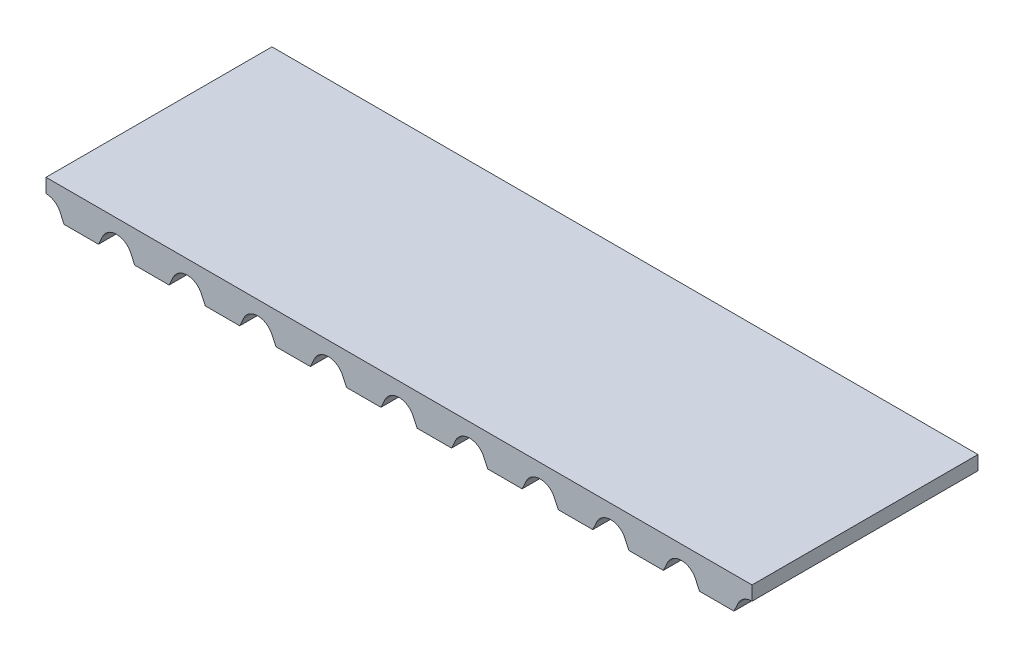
ISO-10303-21;
HEADER;
FILE_DESCRIPTION(('STEP AP214'),'2;1');
FILE_NAME('part.step','',(''),(''),'','','');
FILE_SCHEMA(('AUTOMOTIVE_DESIGN { 1 0 10303 214 1 1 1 1 }'));
ENDSEC;
DATA;
#1=APPLICATION_CONTEXT('core data for automotive mechanical design processes');
#2=APPLICATION_PROTOCOL_DEFINITION('international standard','automotive_design',2000,#1);
#3=PRODUCT_CONTEXT('',#1,'mechanical');
#4=PRODUCT('Part','Part','',(#3));
#5=PRODUCT_RELATED_PRODUCT_CATEGORY('part','',(#4));
#6=PRODUCT_DEFINITION_FORMATION('','',#4);
#7=PRODUCT_DEFINITION_CONTEXT('part definition',#1,'design');
#8=PRODUCT_DEFINITION('design','',#6,#7);
#9=PRODUCT_DEFINITION_SHAPE('','',#8);
#10=(LENGTH_UNIT() NAMED_UNIT(*) SI_UNIT(.MILLI.,.METRE.));
#11=(NAMED_UNIT(*) PLANE_ANGLE_UNIT() SI_UNIT($,.RADIAN.));
#12=(NAMED_UNIT(*) SI_UNIT($,.STERADIAN.) SOLID_ANGLE_UNIT());
#13=UNCERTAINTY_MEASURE_WITH_UNIT(LENGTH_MEASURE(1.E-05),#10,'distance_accuracy_value','');
#14=(GEOMETRIC_REPRESENTATION_CONTEXT(3) GLOBAL_UNCERTAINTY_ASSIGNED_CONTEXT((#13)) GLOBAL_UNIT_ASSIGNED_CONTEXT((#10,
#11,#12)) REPRESENTATION_CONTEXT('',''));
#15=CARTESIAN_POINT('',(0.,0.,0.));
#16=DIRECTION('',(0.,0.,1.));
#17=DIRECTION('',(1.,0.,0.));
#18=AXIS2_PLACEMENT_3D('',#15,#16,#17);
#19=CARTESIAN_POINT('',(-5.,0.,-16.));
#20=DIRECTION('',(-1.,0.,0.));
#21=DIRECTION('',(0.,0.,1.));
#22=AXIS2_PLACEMENT_3D('',#19,#20,#21);
#23=PLANE('',#22);
#24=DIRECTION('',(0.,0.,1.));
#25=VECTOR('',#24,1.);
#26=CARTESIAN_POINT('',(-5.,-2.,-16.));
#27=LINE('',#26,#25);
#28=CARTESIAN_POINT('',(-5.,-2.,-16.));
#29=VERTEX_POINT('',#28);
#30=CARTESIAN_POINT('',(-5.,-2.,16.));
#31=VERTEX_POINT('',#30);
#32=EDGE_CURVE('E33',#29,#31,#27,.T.);
#33=ORIENTED_EDGE('',*,*,#32,.T.);
#34=DIRECTION('',(0.,-1.,0.));
#35=VECTOR('',#34,1.);
#36=CARTESIAN_POINT('',(-5.,0.,16.));
#37=LINE('',#36,#35);
#38=CARTESIAN_POINT('',(-5.,0.,16.));
#39=VERTEX_POINT('',#38);
#40=EDGE_CURVE('E731',#39,#31,#37,.T.);
#41=ORIENTED_EDGE('',*,*,#40,.F.);
#42=DIRECTION('',(0.,0.,1.));
#43=VECTOR('',#42,1.);
#44=CARTESIAN_POINT('',(-5.,0.,-16.));
#45=LINE('',#44,#43);
#46=CARTESIAN_POINT('',(-5.,0.,-16.));
#47=VERTEX_POINT('',#46);
#48=EDGE_CURVE('E11',#47,#39,#45,.T.);
#49=ORIENTED_EDGE('',*,*,#48,.F.);
#50=DIRECTION('',(0.,-1.,0.));
#51=VECTOR('',#50,1.);
#52=CARTESIAN_POINT('',(-5.,0.,-16.));
#53=LINE('',#52,#51);
#54=EDGE_CURVE('E758',#47,#29,#53,.T.);
#55=ORIENTED_EDGE('',*,*,#54,.T.);
#56=EDGE_LOOP('',(#33,#41,#49,#55));
#57=FACE_BOUND('',#56,.T.);
#58=ADVANCED_FACE('F30',(#57),#23,.T.);
#59=CARTESIAN_POINT('',(-5.,0.,-16.));
#60=DIRECTION('',(0.,1.,0.));
#61=DIRECTION('',(0.,0.,1.));
#62=AXIS2_PLACEMENT_3D('',#59,#60,#61);
#63=PLANE('',#62);
#64=ORIENTED_EDGE('',*,*,#48,.T.);
#65=DIRECTION('',(-1.,0.,0.));
#66=VECTOR('',#65,1.);
#67=CARTESIAN_POINT('',(-5.,0.,16.));
#68=LINE('',#67,#66);
#69=CARTESIAN_POINT('',(95.,0.,16.));
#70=VERTEX_POINT('',#69);
#71=EDGE_CURVE('E755',#70,#39,#68,.T.);
#72=ORIENTED_EDGE('',*,*,#71,.F.);
#73=DIRECTION('',(0.,0.,1.));
#74=VECTOR('',#73,1.);
#75=CARTESIAN_POINT('',(95.,0.,-16.));
#76=LINE('',#75,#74);
#77=CARTESIAN_POINT('',(95.,0.,-16.));
#78=VERTEX_POINT('',#77);
#79=EDGE_CURVE('E419',#78,#70,#76,.T.);
#80=ORIENTED_EDGE('',*,*,#79,.F.);
#81=DIRECTION('',(-1.,0.,0.));
#82=VECTOR('',#81,1.);
#83=CARTESIAN_POINT('',(-5.,0.,-16.));
#84=LINE('',#83,#82);
#85=EDGE_CURVE('E773',#78,#47,#84,.T.);
#86=ORIENTED_EDGE('',*,*,#85,.T.);
#87=EDGE_LOOP('',(#64,#72,#80,#86));
#88=FACE_BOUND('',#87,.T.);
#89=ADVANCED_FACE('F791',(#88),#63,.T.);
#90=CARTESIAN_POINT('',(5.00036424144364,-4.19299996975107,-16.));
#91=DIRECTION('',(0.,0.,1.));
#92=DIRECTION('',(1.,0.,0.));
#93=AXIS2_PLACEMENT_3D('',#90,#91,#92);
#94=CYLINDRICAL_SURFACE('',#93,2.193);
#95=DIRECTION('',(0.,0.,1.));
#96=VECTOR('',#95,1.);
#97=CARTESIAN_POINT('',(5.,-2.,-16.));
#98=LINE('',#97,#96);
#99=CARTESIAN_POINT('',(5.,-2.,-16.));
#100=VERTEX_POINT('',#99);
#101=CARTESIAN_POINT('',(5.,-2.,16.));
#102=VERTEX_POINT('',#101);
#103=EDGE_CURVE('E38',#100,#102,#98,.T.);
#104=ORIENTED_EDGE('',*,*,#103,.T.);
#105=CARTESIAN_POINT('',(5.00036424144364,-4.19299996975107,16.));
#106=DIRECTION('',(0.,0.,-1.));
#107=DIRECTION('',(1.,0.,0.));
#108=AXIS2_PLACEMENT_3D('',#105,#106,#107);
#109=CIRCLE('',#108,2.193);
#110=CARTESIAN_POINT('',(3.01283126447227,-3.26619812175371,16.));
#111=VERTEX_POINT('',#110);
#112=EDGE_CURVE('E752',#111,#102,#109,.T.);
#113=ORIENTED_EDGE('',*,*,#112,.F.);
#114=DIRECTION('',(0.,0.,1.));
#115=VECTOR('',#114,1.);
#116=CARTESIAN_POINT('',(3.01283126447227,-3.26619812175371,-16.));
#117=LINE('',#116,#115);
#118=CARTESIAN_POINT('',(3.01283126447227,-3.26619812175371,-16.));
#119=VERTEX_POINT('',#118);
#120=EDGE_CURVE('E777',#119,#111,#117,.T.);
#121=ORIENTED_EDGE('',*,*,#120,.F.);
#122=CARTESIAN_POINT('',(5.00036424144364,-4.19299996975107,-16.));
#123=DIRECTION('',(0.,0.,-1.));
#124=DIRECTION('',(1.,0.,0.));
#125=AXIS2_PLACEMENT_3D('',#122,#123,#124);
#126=CIRCLE('',#125,2.193);
#127=EDGE_CURVE('E52',#119,#100,#126,.T.);
#128=ORIENTED_EDGE('',*,*,#127,.T.);
#129=EDGE_LOOP('',(#104,#113,#121,#128));
#130=FACE_BOUND('',#129,.T.);
#131=ADVANCED_FACE('F993',(#130),#94,.F.);
#132=CARTESIAN_POINT('',(3.01283126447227,-3.26619812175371,-16.));
#133=DIRECTION('',(0.90630778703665,-0.4226182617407,0.));
#134=DIRECTION('',(0.4226182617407,0.90630778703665,0.));
#135=AXIS2_PLACEMENT_3D('',#132,#133,#134);
#136=PLANE('',#135);
#137=ORIENTED_EDGE('',*,*,#120,.T.);
#138=DIRECTION('',(0.4226182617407,0.90630778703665,0.));
#139=VECTOR('',#138,1.);
#140=CARTESIAN_POINT('',(3.01283126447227,-3.26619812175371,16.));
#141=LINE('',#140,#139);
#142=CARTESIAN_POINT('',(2.4375,-4.5,16.));
#143=VERTEX_POINT('',#142);
#144=EDGE_CURVE('E749',#143,#111,#141,.T.);
#145=ORIENTED_EDGE('',*,*,#144,.F.);
#146=DIRECTION('',(0.,0.,1.));
#147=VECTOR('',#146,1.);
#148=CARTESIAN_POINT('',(2.4375,-4.5,-16.));
#149=LINE('',#148,#147);
#150=CARTESIAN_POINT('',(2.4375,-4.5,-16.));
#151=VERTEX_POINT('',#150);
#152=EDGE_CURVE('E779',#151,#143,#149,.T.);
#153=ORIENTED_EDGE('',*,*,#152,.F.);
#154=DIRECTION('',(0.4226182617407,0.90630778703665,0.));
#155=VECTOR('',#154,1.);
#156=CARTESIAN_POINT('',(3.01283126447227,-3.26619812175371,-16.));
#157=LINE('',#156,#155);
#158=EDGE_CURVE('E769',#151,#119,#157,.T.);
#159=ORIENTED_EDGE('',*,*,#158,.T.);
#160=EDGE_LOOP('',(#137,#145,#153,#159));
#161=FACE_BOUND('',#160,.T.);
#162=ADVANCED_FACE('F974',(#161),#136,.T.);
#163=CARTESIAN_POINT('',(-2.4375,-4.5,-16.));
#164=DIRECTION('',(0.,-1.,0.));
#165=DIRECTION('',(1.,0.,0.));
#166=AXIS2_PLACEMENT_3D('',#163,#164,#165);
#167=PLANE('',#166);
#168=ORIENTED_EDGE('',*,*,#152,.T.);
#169=DIRECTION('',(1.,0.,0.));
#170=VECTOR('',#169,1.);
#171=CARTESIAN_POINT('',(-2.4375,-4.5,16.));
#172=LINE('',#171,#170);
#173=CARTESIAN_POINT('',(-2.4375,-4.5,16.));
#174=VERTEX_POINT('',#173);
#175=EDGE_CURVE('E746',#174,#143,#172,.T.);
#176=ORIENTED_EDGE('',*,*,#175,.F.);
#177=DIRECTION('',(0.,0.,1.));
#178=VECTOR('',#177,1.);
#179=CARTESIAN_POINT('',(-2.4375,-4.5,-16.));
#180=LINE('',#179,#178);
#181=CARTESIAN_POINT('',(-2.4375,-4.5,-16.));
#182=VERTEX_POINT('',#181);
#183=EDGE_CURVE('E781',#182,#174,#180,.T.);
#184=ORIENTED_EDGE('',*,*,#183,.F.);
#185=DIRECTION('',(1.,0.,0.));
#186=VECTOR('',#185,1.);
#187=CARTESIAN_POINT('',(-2.4375,-4.5,-16.));
#188=LINE('',#187,#186);
#189=EDGE_CURVE('E766',#182,#151,#188,.T.);
#190=ORIENTED_EDGE('',*,*,#189,.T.);
#191=EDGE_LOOP('',(#168,#176,#184,#190));
#192=FACE_BOUND('',#191,.T.);
#193=ADVANCED_FACE('F978',(#192),#167,.T.);
#194=CARTESIAN_POINT('',(-3.01283126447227,-3.26619812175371,-16.));
#195=DIRECTION('',(-0.906307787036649,-0.422618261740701,0.));
#196=DIRECTION('',(0.422618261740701,-0.906307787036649,0.));
#197=AXIS2_PLACEMENT_3D('',#194,#195,#196);
#198=PLANE('',#197);
#199=ORIENTED_EDGE('',*,*,#183,.T.);
#200=DIRECTION('',(0.422618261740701,-0.906307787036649,0.));
#201=VECTOR('',#200,1.);
#202=CARTESIAN_POINT('',(-3.01283126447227,-3.26619812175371,16.));
#203=LINE('',#202,#201);
#204=CARTESIAN_POINT('',(-3.01283126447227,-3.26619812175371,16.));
#205=VERTEX_POINT('',#204);
#206=EDGE_CURVE('E743',#205,#174,#203,.T.);
#207=ORIENTED_EDGE('',*,*,#206,.F.);
#208=DIRECTION('',(0.,0.,1.));
#209=VECTOR('',#208,1.);
#210=CARTESIAN_POINT('',(-3.01283126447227,-3.26619812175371,-16.));
#211=LINE('',#210,#209);
#212=CARTESIAN_POINT('',(-3.01283126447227,-3.26619812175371,-16.));
#213=VERTEX_POINT('',#212);
#214=EDGE_CURVE('E782',#213,#205,#211,.T.);
#215=ORIENTED_EDGE('',*,*,#214,.F.);
#216=DIRECTION('',(0.422618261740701,-0.906307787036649,0.));
#217=VECTOR('',#216,1.);
#218=CARTESIAN_POINT('',(-3.01283126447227,-3.26619812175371,-16.));
#219=LINE('',#218,#217);
#220=EDGE_CURVE('E763',#213,#182,#219,.T.);
#221=ORIENTED_EDGE('',*,*,#220,.T.);
#222=EDGE_LOOP('',(#199,#207,#215,#221));
#223=FACE_BOUND('',#222,.T.);
#224=ADVANCED_FACE('F980',(#223),#198,.T.);
#225=CARTESIAN_POINT('',(-5.00036424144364,-4.19299996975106,-16.));
#226=DIRECTION('',(0.,0.,1.));
#227=DIRECTION('',(1.,0.,0.));
#228=AXIS2_PLACEMENT_3D('',#225,#226,#227);
#229=CYLINDRICAL_SURFACE('',#228,2.193);
#230=ORIENTED_EDGE('',*,*,#214,.T.);
#231=CARTESIAN_POINT('',(-5.00036424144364,-4.19299996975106,16.));
#232=DIRECTION('',(0.,0.,-1.));
#233=DIRECTION('',(1.,0.,0.));
#234=AXIS2_PLACEMENT_3D('',#231,#232,#233);
#235=CIRCLE('',#234,2.193);
#236=EDGE_CURVE('E740',#31,#205,#235,.T.);
#237=ORIENTED_EDGE('',*,*,#236,.F.);
#238=ORIENTED_EDGE('',*,*,#32,.F.);
#239=CARTESIAN_POINT('',(-5.00036424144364,-4.19299996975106,-16.));
#240=DIRECTION('',(0.,0.,-1.));
#241=DIRECTION('',(1.,0.,0.));
#242=AXIS2_PLACEMENT_3D('',#239,#240,#241);
#243=CIRCLE('',#242,2.193);
#244=EDGE_CURVE('E760',#29,#213,#243,.T.);
#245=ORIENTED_EDGE('',*,*,#244,.T.);
#246=EDGE_LOOP('',(#230,#237,#238,#245));
#247=FACE_BOUND('',#246,.T.);
#248=ADVANCED_FACE('F786',(#247),#229,.F.);
#249=CARTESIAN_POINT('',(-5.00036424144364,-4.19299996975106,-16.));
#250=DIRECTION('',(0.,0.,1.));
#251=DIRECTION('',(1.,0.,0.));
#252=AXIS2_PLACEMENT_3D('',#249,#250,#251);
#253=PLANE('',#252);
#254=ORIENTED_EDGE('',*,*,#54,.F.);
#255=ORIENTED_EDGE('',*,*,#85,.F.);
#256=DIRECTION('',(0.,1.,0.));
#257=VECTOR('',#256,1.);
#258=CARTESIAN_POINT('',(95.,0.,-16.));
#259=LINE('',#258,#257);
#260=CARTESIAN_POINT('',(95.,-2.,-16.));
#261=VERTEX_POINT('',#260);
#262=EDGE_CURVE('E377',#261,#78,#259,.T.);
#263=ORIENTED_EDGE('',*,*,#262,.F.);
#264=CARTESIAN_POINT('',(95.0003642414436,-4.19299996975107,-16.));
#265=DIRECTION('',(0.,0.,-1.));
#266=DIRECTION('',(1.,0.,0.));
#267=AXIS2_PLACEMENT_3D('',#264,#265,#266);
#268=CIRCLE('',#267,2.193);
#269=CARTESIAN_POINT('',(93.0128312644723,-3.26619812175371,-16.));
#270=VERTEX_POINT('',#269);
#271=EDGE_CURVE('E414',#270,#261,#268,.T.);
#272=ORIENTED_EDGE('',*,*,#271,.F.);
#273=DIRECTION('',(0.4226182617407,0.90630778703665,0.));
#274=VECTOR('',#273,1.);
#275=CARTESIAN_POINT('',(93.0128312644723,-3.26619812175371,-16.));
#276=LINE('',#275,#274);
#277=CARTESIAN_POINT('',(92.4375,-4.5,-16.));
#278=VERTEX_POINT('',#277);
#279=EDGE_CURVE('E411',#278,#270,#276,.T.);
#280=ORIENTED_EDGE('',*,*,#279,.F.);
#281=DIRECTION('',(1.,0.,0.));
#282=VECTOR('',#281,1.);
#283=CARTESIAN_POINT('',(87.5625,-4.5,-16.));
#284=LINE('',#283,#282);
#285=CARTESIAN_POINT('',(87.5625,-4.5,-16.));
#286=VERTEX_POINT('',#285);
#287=EDGE_CURVE('E408',#286,#278,#284,.T.);
#288=ORIENTED_EDGE('',*,*,#287,.F.);
#289=DIRECTION('',(0.422618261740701,-0.906307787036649,0.));
#290=VECTOR('',#289,1.);
#291=CARTESIAN_POINT('',(86.9871687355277,-3.26619812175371,-16.));
#292=LINE('',#291,#290);
#293=CARTESIAN_POINT('',(86.9871687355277,-3.26619812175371,-16.));
#294=VERTEX_POINT('',#293);
#295=EDGE_CURVE('E406',#294,#286,#292,.T.);
#296=ORIENTED_EDGE('',*,*,#295,.F.);
#297=CARTESIAN_POINT('',(84.9996357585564,-4.19299996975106,-16.));
#298=DIRECTION('',(0.,0.,-1.));
#299=DIRECTION('',(1.,0.,0.));
#300=AXIS2_PLACEMENT_3D('',#297,#298,#299);
#301=CIRCLE('',#300,2.193);
#302=CARTESIAN_POINT('',(85.,-2.,-16.));
#303=VERTEX_POINT('',#302);
#304=EDGE_CURVE('E371',#303,#294,#301,.T.);
#305=ORIENTED_EDGE('',*,*,#304,.F.);
#306=CARTESIAN_POINT('',(85.0003642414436,-4.19299996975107,-16.));
#307=DIRECTION('',(0.,0.,-1.));
#308=DIRECTION('',(1.,0.,0.));
#309=AXIS2_PLACEMENT_3D('',#306,#307,#308);
#310=CIRCLE('',#309,2.193);
#311=CARTESIAN_POINT('',(83.0128312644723,-3.26619812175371,-16.));
#312=VERTEX_POINT('',#311);
#313=EDGE_CURVE('E453',#312,#303,#310,.T.);
#314=ORIENTED_EDGE('',*,*,#313,.F.);
#315=DIRECTION('',(0.4226182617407,0.90630778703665,0.));
#316=VECTOR('',#315,1.);
#317=CARTESIAN_POINT('',(83.0128312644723,-3.26619812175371,-16.));
#318=LINE('',#317,#316);
#319=CARTESIAN_POINT('',(82.4375,-4.5,-16.));
#320=VERTEX_POINT('',#319);
#321=EDGE_CURVE('E450',#320,#312,#318,.T.);
#322=ORIENTED_EDGE('',*,*,#321,.F.);
#323=DIRECTION('',(1.,0.,0.));
#324=VECTOR('',#323,1.);
#325=CARTESIAN_POINT('',(77.5625,-4.5,-16.));
#326=LINE('',#325,#324);
#327=CARTESIAN_POINT('',(77.5625,-4.5,-16.));
#328=VERTEX_POINT('',#327);
#329=EDGE_CURVE('E447',#328,#320,#326,.T.);
#330=ORIENTED_EDGE('',*,*,#329,.F.);
#331=DIRECTION('',(0.422618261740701,-0.906307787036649,0.));
#332=VECTOR('',#331,1.);
#333=CARTESIAN_POINT('',(76.9871687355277,-3.26619812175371,-16.));
#334=LINE('',#333,#332);
#335=CARTESIAN_POINT('',(76.9871687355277,-3.26619812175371,-16.));
#336=VERTEX_POINT('',#335);
#337=EDGE_CURVE('E444',#336,#328,#334,.T.);
#338=ORIENTED_EDGE('',*,*,#337,.F.);
#339=CARTESIAN_POINT('',(74.9996357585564,-4.19299996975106,-16.));
#340=DIRECTION('',(0.,0.,-1.));
#341=DIRECTION('',(1.,0.,0.));
#342=AXIS2_PLACEMENT_3D('',#339,#340,#341);
#343=CIRCLE('',#342,2.193);
#344=CARTESIAN_POINT('',(75.,-2.,-16.));
#345=VERTEX_POINT('',#344);
#346=EDGE_CURVE('E441',#345,#336,#343,.T.);
#347=ORIENTED_EDGE('',*,*,#346,.F.);
#348=CARTESIAN_POINT('',(75.0003642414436,-4.19299996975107,-16.));
#349=DIRECTION('',(0.,0.,-1.));
#350=DIRECTION('',(1.,0.,0.));
#351=AXIS2_PLACEMENT_3D('',#348,#349,#350);
#352=CIRCLE('',#351,2.193);
#353=CARTESIAN_POINT('',(73.0128312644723,-3.26619812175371,-16.));
#354=VERTEX_POINT('',#353);
#355=EDGE_CURVE('E492',#354,#345,#352,.T.);
#356=ORIENTED_EDGE('',*,*,#355,.F.);
#357=DIRECTION('',(0.4226182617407,0.90630778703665,0.));
#358=VECTOR('',#357,1.);
#359=CARTESIAN_POINT('',(73.0128312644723,-3.26619812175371,-16.));
#360=LINE('',#359,#358);
#361=CARTESIAN_POINT('',(72.4375,-4.5,-16.));
#362=VERTEX_POINT('',#361);
#363=EDGE_CURVE('E489',#362,#354,#360,.T.);
#364=ORIENTED_EDGE('',*,*,#363,.F.);
#365=DIRECTION('',(1.,0.,0.));
#366=VECTOR('',#365,1.);
#367=CARTESIAN_POINT('',(67.5625,-4.5,-16.));
#368=LINE('',#367,#366);
#369=CARTESIAN_POINT('',(67.5625,-4.5,-16.));
#370=VERTEX_POINT('',#369);
#371=EDGE_CURVE('E486',#370,#362,#368,.T.);
#372=ORIENTED_EDGE('',*,*,#371,.F.);
#373=DIRECTION('',(0.422618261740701,-0.906307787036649,0.));
#374=VECTOR('',#373,1.);
#375=CARTESIAN_POINT('',(66.9871687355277,-3.26619812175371,-16.));
#376=LINE('',#375,#374);
#377=CARTESIAN_POINT('',(66.9871687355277,-3.26619812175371,-16.));
#378=VERTEX_POINT('',#377);
#379=EDGE_CURVE('E483',#378,#370,#376,.T.);
#380=ORIENTED_EDGE('',*,*,#379,.F.);
#381=CARTESIAN_POINT('',(64.9996357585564,-4.19299996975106,-16.));
#382=DIRECTION('',(0.,0.,-1.));
#383=DIRECTION('',(1.,0.,0.));
#384=AXIS2_PLACEMENT_3D('',#381,#382,#383);
#385=CIRCLE('',#384,2.193);
#386=CARTESIAN_POINT('',(65.,-2.,-16.));
#387=VERTEX_POINT('',#386);
#388=EDGE_CURVE('E480',#387,#378,#385,.T.);
#389=ORIENTED_EDGE('',*,*,#388,.F.);
#390=CARTESIAN_POINT('',(65.0003642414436,-4.19299996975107,-16.));
#391=DIRECTION('',(0.,0.,-1.));
#392=DIRECTION('',(1.,0.,0.));
#393=AXIS2_PLACEMENT_3D('',#390,#391,#392);
#394=CIRCLE('',#393,2.193);
#395=CARTESIAN_POINT('',(63.0128312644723,-3.26619812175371,-16.));
#396=VERTEX_POINT('',#395);
#397=EDGE_CURVE('E531',#396,#387,#394,.T.);
#398=ORIENTED_EDGE('',*,*,#397,.F.);
#399=DIRECTION('',(0.4226182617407,0.90630778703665,0.));
#400=VECTOR('',#399,1.);
#401=CARTESIAN_POINT('',(63.0128312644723,-3.26619812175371,-16.));
#402=LINE('',#401,#400);
#403=CARTESIAN_POINT('',(62.4375,-4.5,-16.));
#404=VERTEX_POINT('',#403);
#405=EDGE_CURVE('E528',#404,#396,#402,.T.);
#406=ORIENTED_EDGE('',*,*,#405,.F.);
#407=DIRECTION('',(1.,0.,0.));
#408=VECTOR('',#407,1.);
#409=CARTESIAN_POINT('',(57.5625,-4.5,-16.));
#410=LINE('',#409,#408);
#411=CARTESIAN_POINT('',(57.5625,-4.5,-16.));
#412=VERTEX_POINT('',#411);
#413=EDGE_CURVE('E525',#412,#404,#410,.T.);
#414=ORIENTED_EDGE('',*,*,#413,.F.);
#415=DIRECTION('',(0.422618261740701,-0.906307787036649,0.));
#416=VECTOR('',#415,1.);
#417=CARTESIAN_POINT('',(56.9871687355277,-3.26619812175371,-16.));
#418=LINE('',#417,#416);
#419=CARTESIAN_POINT('',(56.9871687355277,-3.26619812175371,-16.));
#420=VERTEX_POINT('',#419);
#421=EDGE_CURVE('E522',#420,#412,#418,.T.);
#422=ORIENTED_EDGE('',*,*,#421,.F.);
#423=CARTESIAN_POINT('',(54.9996357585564,-4.19299996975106,-16.));
#424=DIRECTION('',(0.,0.,-1.));
#425=DIRECTION('',(1.,0.,0.));
#426=AXIS2_PLACEMENT_3D('',#423,#424,#425);
#427=CIRCLE('',#426,2.193);
#428=CARTESIAN_POINT('',(55.,-2.,-16.));
#429=VERTEX_POINT('',#428);
#430=EDGE_CURVE('E519',#429,#420,#427,.T.);
#431=ORIENTED_EDGE('',*,*,#430,.F.);
#432=CARTESIAN_POINT('',(55.0003642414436,-4.19299996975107,-16.));
#433=DIRECTION('',(0.,0.,-1.));
#434=DIRECTION('',(1.,0.,0.));
#435=AXIS2_PLACEMENT_3D('',#432,#433,#434);
#436=CIRCLE('',#435,2.193);
#437=CARTESIAN_POINT('',(53.0128312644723,-3.26619812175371,-16.));
#438=VERTEX_POINT('',#437);
#439=EDGE_CURVE('E570',#438,#429,#436,.T.);
#440=ORIENTED_EDGE('',*,*,#439,.F.);
#441=DIRECTION('',(0.4226182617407,0.90630778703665,0.));
#442=VECTOR('',#441,1.);
#443=CARTESIAN_POINT('',(53.0128312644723,-3.26619812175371,-16.));
#444=LINE('',#443,#442);
#445=CARTESIAN_POINT('',(52.4375,-4.5,-16.));
#446=VERTEX_POINT('',#445);
#447=EDGE_CURVE('E567',#446,#438,#444,.T.);
#448=ORIENTED_EDGE('',*,*,#447,.F.);
#449=DIRECTION('',(1.,0.,0.));
#450=VECTOR('',#449,1.);
#451=CARTESIAN_POINT('',(47.5625,-4.5,-16.));
#452=LINE('',#451,#450);
#453=CARTESIAN_POINT('',(47.5625,-4.5,-16.));
#454=VERTEX_POINT('',#453);
#455=EDGE_CURVE('E564',#454,#446,#452,.T.);
#456=ORIENTED_EDGE('',*,*,#455,.F.);
#457=DIRECTION('',(0.422618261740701,-0.906307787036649,0.));
#458=VECTOR('',#457,1.);
#459=CARTESIAN_POINT('',(46.9871687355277,-3.26619812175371,-16.));
#460=LINE('',#459,#458);
#461=CARTESIAN_POINT('',(46.9871687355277,-3.26619812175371,-16.));
#462=VERTEX_POINT('',#461);
#463=EDGE_CURVE('E561',#462,#454,#460,.T.);
#464=ORIENTED_EDGE('',*,*,#463,.F.);
#465=CARTESIAN_POINT('',(44.9996357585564,-4.19299996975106,-16.));
#466=DIRECTION('',(0.,0.,-1.));
#467=DIRECTION('',(1.,0.,0.));
#468=AXIS2_PLACEMENT_3D('',#465,#466,#467);
#469=CIRCLE('',#468,2.193);
#470=CARTESIAN_POINT('',(45.,-2.,-16.));
#471=VERTEX_POINT('',#470);
#472=EDGE_CURVE('E558',#471,#462,#469,.T.);
#473=ORIENTED_EDGE('',*,*,#472,.F.);
#474=CARTESIAN_POINT('',(45.0003642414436,-4.19299996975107,-16.));
#475=DIRECTION('',(0.,0.,-1.));
#476=DIRECTION('',(1.,0.,0.));
#477=AXIS2_PLACEMENT_3D('',#474,#475,#476);
#478=CIRCLE('',#477,2.193);
#479=CARTESIAN_POINT('',(43.0128312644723,-3.26619812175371,-16.));
#480=VERTEX_POINT('',#479);
#481=EDGE_CURVE('E609',#480,#471,#478,.T.);
#482=ORIENTED_EDGE('',*,*,#481,.F.);
#483=DIRECTION('',(0.4226182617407,0.90630778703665,0.));
#484=VECTOR('',#483,1.);
#485=CARTESIAN_POINT('',(43.0128312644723,-3.26619812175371,-16.));
#486=LINE('',#485,#484);
#487=CARTESIAN_POINT('',(42.4375,-4.5,-16.));
#488=VERTEX_POINT('',#487);
#489=EDGE_CURVE('E606',#488,#480,#486,.T.);
#490=ORIENTED_EDGE('',*,*,#489,.F.);
#491=DIRECTION('',(1.,0.,0.));
#492=VECTOR('',#491,1.);
#493=CARTESIAN_POINT('',(37.5625,-4.5,-16.));
#494=LINE('',#493,#492);
#495=CARTESIAN_POINT('',(37.5625,-4.5,-16.));
#496=VERTEX_POINT('',#495);
#497=EDGE_CURVE('E603',#496,#488,#494,.T.);
#498=ORIENTED_EDGE('',*,*,#497,.F.);
#499=DIRECTION('',(0.422618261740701,-0.906307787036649,0.));
#500=VECTOR('',#499,1.);
#501=CARTESIAN_POINT('',(36.9871687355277,-3.26619812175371,-16.));
#502=LINE('',#501,#500);
#503=CARTESIAN_POINT('',(36.9871687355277,-3.26619812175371,-16.));
#504=VERTEX_POINT('',#503);
#505=EDGE_CURVE('E600',#504,#496,#502,.T.);
#506=ORIENTED_EDGE('',*,*,#505,.F.);
#507=CARTESIAN_POINT('',(34.9996357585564,-4.19299996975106,-16.));
#508=DIRECTION('',(0.,0.,-1.));
#509=DIRECTION('',(1.,0.,0.));
#510=AXIS2_PLACEMENT_3D('',#507,#508,#509);
#511=CIRCLE('',#510,2.193);
#512=CARTESIAN_POINT('',(35.,-2.,-16.));
#513=VERTEX_POINT('',#512);
#514=EDGE_CURVE('E597',#513,#504,#511,.T.);
#515=ORIENTED_EDGE('',*,*,#514,.F.);
#516=CARTESIAN_POINT('',(35.0003642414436,-4.19299996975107,-16.));
#517=DIRECTION('',(0.,0.,-1.));
#518=DIRECTION('',(1.,0.,0.));
#519=AXIS2_PLACEMENT_3D('',#516,#517,#518);
#520=CIRCLE('',#519,2.193);
#521=CARTESIAN_POINT('',(33.0128312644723,-3.26619812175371,-16.));
#522=VERTEX_POINT('',#521);
#523=EDGE_CURVE('E648',#522,#513,#520,.T.);
#524=ORIENTED_EDGE('',*,*,#523,.F.);
#525=DIRECTION('',(0.4226182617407,0.90630778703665,0.));
#526=VECTOR('',#525,1.);
#527=CARTESIAN_POINT('',(33.0128312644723,-3.26619812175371,-16.));
#528=LINE('',#527,#526);
#529=CARTESIAN_POINT('',(32.4375,-4.5,-16.));
#530=VERTEX_POINT('',#529);
#531=EDGE_CURVE('E645',#530,#522,#528,.T.);
#532=ORIENTED_EDGE('',*,*,#531,.F.);
#533=DIRECTION('',(1.,0.,0.));
#534=VECTOR('',#533,1.);
#535=CARTESIAN_POINT('',(27.5625,-4.5,-16.));
#536=LINE('',#535,#534);
#537=CARTESIAN_POINT('',(27.5625,-4.5,-16.));
#538=VERTEX_POINT('',#537);
#539=EDGE_CURVE('E642',#538,#530,#536,.T.);
#540=ORIENTED_EDGE('',*,*,#539,.F.);
#541=DIRECTION('',(0.422618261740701,-0.906307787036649,0.));
#542=VECTOR('',#541,1.);
#543=CARTESIAN_POINT('',(26.9871687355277,-3.26619812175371,-16.));
#544=LINE('',#543,#542);
#545=CARTESIAN_POINT('',(26.9871687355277,-3.26619812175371,-16.));
#546=VERTEX_POINT('',#545);
#547=EDGE_CURVE('E639',#546,#538,#544,.T.);
#548=ORIENTED_EDGE('',*,*,#547,.F.);
#549=CARTESIAN_POINT('',(24.9996357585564,-4.19299996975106,-16.));
#550=DIRECTION('',(0.,0.,-1.));
#551=DIRECTION('',(1.,0.,0.));
#552=AXIS2_PLACEMENT_3D('',#549,#550,#551);
#553=CIRCLE('',#552,2.193);
#554=CARTESIAN_POINT('',(25.,-2.,-16.));
#555=VERTEX_POINT('',#554);
#556=EDGE_CURVE('E636',#555,#546,#553,.T.);
#557=ORIENTED_EDGE('',*,*,#556,.F.);
#558=CARTESIAN_POINT('',(25.0003642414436,-4.19299996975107,-16.));
#559=DIRECTION('',(0.,0.,-1.));
#560=DIRECTION('',(1.,0.,0.));
#561=AXIS2_PLACEMENT_3D('',#558,#559,#560);
#562=CIRCLE('',#561,2.193);
#563=CARTESIAN_POINT('',(23.0128312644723,-3.26619812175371,-16.));
#564=VERTEX_POINT('',#563);
#565=EDGE_CURVE('E687',#564,#555,#562,.T.);
#566=ORIENTED_EDGE('',*,*,#565,.F.);
#567=DIRECTION('',(0.4226182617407,0.90630778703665,0.));
#568=VECTOR('',#567,1.);
#569=CARTESIAN_POINT('',(23.0128312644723,-3.26619812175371,-16.));
#570=LINE('',#569,#568);
#571=CARTESIAN_POINT('',(22.4375,-4.5,-16.));
#572=VERTEX_POINT('',#571);
#573=EDGE_CURVE('E684',#572,#564,#570,.T.);
#574=ORIENTED_EDGE('',*,*,#573,.F.);
#575=DIRECTION('',(1.,0.,0.));
#576=VECTOR('',#575,1.);
#577=CARTESIAN_POINT('',(17.5625,-4.5,-16.));
#578=LINE('',#577,#576);
#579=CARTESIAN_POINT('',(17.5625,-4.5,-16.));
#580=VERTEX_POINT('',#579);
#581=EDGE_CURVE('E681',#580,#572,#578,.T.);
#582=ORIENTED_EDGE('',*,*,#581,.F.);
#583=DIRECTION('',(0.422618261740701,-0.906307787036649,0.));
#584=VECTOR('',#583,1.);
#585=CARTESIAN_POINT('',(16.9871687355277,-3.26619812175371,-16.));
#586=LINE('',#585,#584);
#587=CARTESIAN_POINT('',(16.9871687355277,-3.26619812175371,-16.));
#588=VERTEX_POINT('',#587);
#589=EDGE_CURVE('E678',#588,#580,#586,.T.);
#590=ORIENTED_EDGE('',*,*,#589,.F.);
#591=CARTESIAN_POINT('',(14.9996357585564,-4.19299996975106,-16.));
#592=DIRECTION('',(0.,0.,-1.));
#593=DIRECTION('',(1.,0.,0.));
#594=AXIS2_PLACEMENT_3D('',#591,#592,#593);
#595=CIRCLE('',#594,2.193);
#596=CARTESIAN_POINT('',(15.,-2.,-16.));
#597=VERTEX_POINT('',#596);
#598=EDGE_CURVE('E675',#597,#588,#595,.T.);
#599=ORIENTED_EDGE('',*,*,#598,.F.);
#600=CARTESIAN_POINT('',(15.0003642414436,-4.19299996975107,-16.));
#601=DIRECTION('',(0.,0.,-1.));
#602=DIRECTION('',(1.,0.,0.));
#603=AXIS2_PLACEMENT_3D('',#600,#601,#602);
#604=CIRCLE('',#603,2.193);
#605=CARTESIAN_POINT('',(13.0128312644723,-3.26619812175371,-16.));
#606=VERTEX_POINT('',#605);
#607=EDGE_CURVE('E726',#606,#597,#604,.T.);
#608=ORIENTED_EDGE('',*,*,#607,.F.);
#609=DIRECTION('',(0.4226182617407,0.90630778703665,0.));
#610=VECTOR('',#609,1.);
#611=CARTESIAN_POINT('',(13.0128312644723,-3.26619812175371,-16.));
#612=LINE('',#611,#610);
#613=CARTESIAN_POINT('',(12.4375,-4.5,-16.));
#614=VERTEX_POINT('',#613);
#615=EDGE_CURVE('E723',#614,#606,#612,.T.);
#616=ORIENTED_EDGE('',*,*,#615,.F.);
#617=DIRECTION('',(1.,0.,0.));
#618=VECTOR('',#617,1.);
#619=CARTESIAN_POINT('',(7.5625,-4.5,-16.));
#620=LINE('',#619,#618);
#621=CARTESIAN_POINT('',(7.5625,-4.5,-16.));
#622=VERTEX_POINT('',#621);
#623=EDGE_CURVE('E720',#622,#614,#620,.T.);
#624=ORIENTED_EDGE('',*,*,#623,.F.);
#625=DIRECTION('',(0.422618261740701,-0.906307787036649,0.));
#626=VECTOR('',#625,1.);
#627=CARTESIAN_POINT('',(6.98716873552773,-3.26619812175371,-16.));
#628=LINE('',#627,#626);
#629=CARTESIAN_POINT('',(6.98716873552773,-3.26619812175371,-16.));
#630=VERTEX_POINT('',#629);
#631=EDGE_CURVE('E717',#630,#622,#628,.T.);
#632=ORIENTED_EDGE('',*,*,#631,.F.);
#633=CARTESIAN_POINT('',(4.99963575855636,-4.19299996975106,-16.));
#634=DIRECTION('',(0.,0.,-1.));
#635=DIRECTION('',(1.,0.,0.));
#636=AXIS2_PLACEMENT_3D('',#633,#634,#635);
#637=CIRCLE('',#636,2.193);
#638=EDGE_CURVE('E714',#100,#630,#637,.T.);
#639=ORIENTED_EDGE('',*,*,#638,.F.);
#640=ORIENTED_EDGE('',*,*,#127,.F.);
#641=ORIENTED_EDGE('',*,*,#158,.F.);
#642=ORIENTED_EDGE('',*,*,#189,.F.);
#643=ORIENTED_EDGE('',*,*,#220,.F.);
#644=ORIENTED_EDGE('',*,*,#244,.F.);
#645=EDGE_LOOP('',(#254,#255,#263,#272,#280,#288,#296,#305,#314,#322,#330,#338,#347,#356,#364,
#372,#380,#389,#398,#406,#414,#422,#431,#440,#448,#456,#464,#473,#482,#490,#498,#506,#515,#524,
#532,#540,#548,#557,#566,#574,#582,#590,#599,#608,#616,#624,#632,#639,#640,#641,#642,#643,#644));
#646=FACE_BOUND('',#645,.T.);
#647=ADVANCED_FACE('F797',(#646),#253,.F.);
#648=CARTESIAN_POINT('',(-5.00036424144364,-4.19299996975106,16.));
#649=DIRECTION('',(0.,0.,1.));
#650=DIRECTION('',(1.,0.,0.));
#651=AXIS2_PLACEMENT_3D('',#648,#649,#650);
#652=PLANE('',#651);
#653=ORIENTED_EDGE('',*,*,#40,.T.);
#654=ORIENTED_EDGE('',*,*,#236,.T.);
#655=ORIENTED_EDGE('',*,*,#206,.T.);
#656=ORIENTED_EDGE('',*,*,#175,.T.);
#657=ORIENTED_EDGE('',*,*,#144,.T.);
#658=ORIENTED_EDGE('',*,*,#112,.T.);
#659=CARTESIAN_POINT('',(4.99963575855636,-4.19299996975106,16.));
#660=DIRECTION('',(0.,0.,-1.));
#661=DIRECTION('',(1.,0.,0.));
#662=AXIS2_PLACEMENT_3D('',#659,#660,#661);
#663=CIRCLE('',#662,2.193);
#664=CARTESIAN_POINT('',(6.98716873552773,-3.26619812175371,16.));
#665=VERTEX_POINT('',#664);
#666=EDGE_CURVE('E692',#102,#665,#663,.T.);
#667=ORIENTED_EDGE('',*,*,#666,.T.);
#668=DIRECTION('',(0.422618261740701,-0.906307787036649,0.));
#669=VECTOR('',#668,1.);
#670=CARTESIAN_POINT('',(6.98716873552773,-3.26619812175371,16.));
#671=LINE('',#670,#669);
#672=CARTESIAN_POINT('',(7.5625,-4.5,16.));
#673=VERTEX_POINT('',#672);
#674=EDGE_CURVE('E702',#665,#673,#671,.T.);
#675=ORIENTED_EDGE('',*,*,#674,.T.);
#676=DIRECTION('',(1.,0.,0.));
#677=VECTOR('',#676,1.);
#678=CARTESIAN_POINT('',(7.5625,-4.5,16.));
#679=LINE('',#678,#677);
#680=CARTESIAN_POINT('',(12.4375,-4.5,16.));
#681=VERTEX_POINT('',#680);
#682=EDGE_CURVE('E705',#673,#681,#679,.T.);
#683=ORIENTED_EDGE('',*,*,#682,.T.);
#684=DIRECTION('',(0.4226182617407,0.90630778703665,0.));
#685=VECTOR('',#684,1.);
#686=CARTESIAN_POINT('',(13.0128312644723,-3.26619812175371,16.));
#687=LINE('',#686,#685);
#688=CARTESIAN_POINT('',(13.0128312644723,-3.26619812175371,16.));
#689=VERTEX_POINT('',#688);
#690=EDGE_CURVE('E708',#681,#689,#687,.T.);
#691=ORIENTED_EDGE('',*,*,#690,.T.);
#692=CARTESIAN_POINT('',(15.0003642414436,-4.19299996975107,16.));
#693=DIRECTION('',(0.,0.,-1.));
#694=DIRECTION('',(1.,0.,0.));
#695=AXIS2_PLACEMENT_3D('',#692,#693,#694);
#696=CIRCLE('',#695,2.193);
#697=CARTESIAN_POINT('',(15.,-2.,16.));
#698=VERTEX_POINT('',#697);
#699=EDGE_CURVE('E711',#689,#698,#696,.T.);
#700=ORIENTED_EDGE('',*,*,#699,.T.);
#701=CARTESIAN_POINT('',(14.9996357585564,-4.19299996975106,16.));
#702=DIRECTION('',(0.,0.,-1.));
#703=DIRECTION('',(1.,0.,0.));
#704=AXIS2_PLACEMENT_3D('',#701,#702,#703);
#705=CIRCLE('',#704,2.193);
#706=CARTESIAN_POINT('',(16.9871687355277,-3.26619812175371,16.));
#707=VERTEX_POINT('',#706);
#708=EDGE_CURVE('E653',#698,#707,#705,.T.);
#709=ORIENTED_EDGE('',*,*,#708,.T.);
#710=DIRECTION('',(0.422618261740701,-0.906307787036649,0.));
#711=VECTOR('',#710,1.);
#712=CARTESIAN_POINT('',(16.9871687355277,-3.26619812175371,16.));
#713=LINE('',#712,#711);
#714=CARTESIAN_POINT('',(17.5625,-4.5,16.));
#715=VERTEX_POINT('',#714);
#716=EDGE_CURVE('E663',#707,#715,#713,.T.);
#717=ORIENTED_EDGE('',*,*,#716,.T.);
#718=DIRECTION('',(1.,0.,0.));
#719=VECTOR('',#718,1.);
#720=CARTESIAN_POINT('',(17.5625,-4.5,16.));
#721=LINE('',#720,#719);
#722=CARTESIAN_POINT('',(22.4375,-4.5,16.));
#723=VERTEX_POINT('',#722);
#724=EDGE_CURVE('E666',#715,#723,#721,.T.);
#725=ORIENTED_EDGE('',*,*,#724,.T.);
#726=DIRECTION('',(0.4226182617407,0.90630778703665,0.));
#727=VECTOR('',#726,1.);
#728=CARTESIAN_POINT('',(23.0128312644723,-3.26619812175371,16.));
#729=LINE('',#728,#727);
#730=CARTESIAN_POINT('',(23.0128312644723,-3.26619812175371,16.));
#731=VERTEX_POINT('',#730);
#732=EDGE_CURVE('E669',#723,#731,#729,.T.);
#733=ORIENTED_EDGE('',*,*,#732,.T.);
#734=CARTESIAN_POINT('',(25.0003642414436,-4.19299996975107,16.));
#735=DIRECTION('',(0.,0.,-1.));
#736=DIRECTION('',(1.,0.,0.));
#737=AXIS2_PLACEMENT_3D('',#734,#735,#736);
#738=CIRCLE('',#737,2.193);
#739=CARTESIAN_POINT('',(25.,-2.,16.));
#740=VERTEX_POINT('',#739);
#741=EDGE_CURVE('E672',#731,#740,#738,.T.);
#742=ORIENTED_EDGE('',*,*,#741,.T.);
#743=CARTESIAN_POINT('',(24.9996357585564,-4.19299996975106,16.));
#744=DIRECTION('',(0.,0.,-1.));
#745=DIRECTION('',(1.,0.,0.));
#746=AXIS2_PLACEMENT_3D('',#743,#744,#745);
#747=CIRCLE('',#746,2.193);
#748=CARTESIAN_POINT('',(26.9871687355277,-3.26619812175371,16.));
#749=VERTEX_POINT('',#748);
#750=EDGE_CURVE('E614',#740,#749,#747,.T.);
#751=ORIENTED_EDGE('',*,*,#750,.T.);
#752=DIRECTION('',(0.422618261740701,-0.906307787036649,0.));
#753=VECTOR('',#752,1.);
#754=CARTESIAN_POINT('',(26.9871687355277,-3.26619812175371,16.));
#755=LINE('',#754,#753);
#756=CARTESIAN_POINT('',(27.5625,-4.5,16.));
#757=VERTEX_POINT('',#756);
#758=EDGE_CURVE('E624',#749,#757,#755,.T.);
#759=ORIENTED_EDGE('',*,*,#758,.T.);
#760=DIRECTION('',(1.,0.,0.));
#761=VECTOR('',#760,1.);
#762=CARTESIAN_POINT('',(27.5625,-4.5,16.));
#763=LINE('',#762,#761);
#764=CARTESIAN_POINT('',(32.4375,-4.5,16.));
#765=VERTEX_POINT('',#764);
#766=EDGE_CURVE('E627',#757,#765,#763,.T.);
#767=ORIENTED_EDGE('',*,*,#766,.T.);
#768=DIRECTION('',(0.4226182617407,0.90630778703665,0.));
#769=VECTOR('',#768,1.);
#770=CARTESIAN_POINT('',(33.0128312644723,-3.26619812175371,16.));
#771=LINE('',#770,#769);
#772=CARTESIAN_POINT('',(33.0128312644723,-3.26619812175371,16.));
#773=VERTEX_POINT('',#772);
#774=EDGE_CURVE('E630',#765,#773,#771,.T.);
#775=ORIENTED_EDGE('',*,*,#774,.T.);
#776=CARTESIAN_POINT('',(35.0003642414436,-4.19299996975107,16.));
#777=DIRECTION('',(0.,0.,-1.));
#778=DIRECTION('',(1.,0.,0.));
#779=AXIS2_PLACEMENT_3D('',#776,#777,#778);
#780=CIRCLE('',#779,2.193);
#781=CARTESIAN_POINT('',(35.,-2.,16.));
#782=VERTEX_POINT('',#781);
#783=EDGE_CURVE('E633',#773,#782,#780,.T.);
#784=ORIENTED_EDGE('',*,*,#783,.T.);
#785=CARTESIAN_POINT('',(34.9996357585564,-4.19299996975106,16.));
#786=DIRECTION('',(0.,0.,-1.));
#787=DIRECTION('',(1.,0.,0.));
#788=AXIS2_PLACEMENT_3D('',#785,#786,#787);
#789=CIRCLE('',#788,2.193);
#790=CARTESIAN_POINT('',(36.9871687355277,-3.26619812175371,16.));
#791=VERTEX_POINT('',#790);
#792=EDGE_CURVE('E575',#782,#791,#789,.T.);
#793=ORIENTED_EDGE('',*,*,#792,.T.);
#794=DIRECTION('',(0.422618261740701,-0.906307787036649,0.));
#795=VECTOR('',#794,1.);
#796=CARTESIAN_POINT('',(36.9871687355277,-3.26619812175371,16.));
#797=LINE('',#796,#795);
#798=CARTESIAN_POINT('',(37.5625,-4.5,16.));
#799=VERTEX_POINT('',#798);
#800=EDGE_CURVE('E585',#791,#799,#797,.T.);
#801=ORIENTED_EDGE('',*,*,#800,.T.);
#802=DIRECTION('',(1.,0.,0.));
#803=VECTOR('',#802,1.);
#804=CARTESIAN_POINT('',(37.5625,-4.5,16.));
#805=LINE('',#804,#803);
#806=CARTESIAN_POINT('',(42.4375,-4.5,16.));
#807=VERTEX_POINT('',#806);
#808=EDGE_CURVE('E588',#799,#807,#805,.T.);
#809=ORIENTED_EDGE('',*,*,#808,.T.);
#810=DIRECTION('',(0.4226182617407,0.90630778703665,0.));
#811=VECTOR('',#810,1.);
#812=CARTESIAN_POINT('',(43.0128312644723,-3.26619812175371,16.));
#813=LINE('',#812,#811);
#814=CARTESIAN_POINT('',(43.0128312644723,-3.26619812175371,16.));
#815=VERTEX_POINT('',#814);
#816=EDGE_CURVE('E591',#807,#815,#813,.T.);
#817=ORIENTED_EDGE('',*,*,#816,.T.);
#818=CARTESIAN_POINT('',(45.0003642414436,-4.19299996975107,16.));
#819=DIRECTION('',(0.,0.,-1.));
#820=DIRECTION('',(1.,0.,0.));
#821=AXIS2_PLACEMENT_3D('',#818,#819,#820);
#822=CIRCLE('',#821,2.193);
#823=CARTESIAN_POINT('',(45.,-2.,16.));
#824=VERTEX_POINT('',#823);
#825=EDGE_CURVE('E594',#815,#824,#822,.T.);
#826=ORIENTED_EDGE('',*,*,#825,.T.);
#827=CARTESIAN_POINT('',(44.9996357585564,-4.19299996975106,16.));
#828=DIRECTION('',(0.,0.,-1.));
#829=DIRECTION('',(1.,0.,0.));
#830=AXIS2_PLACEMENT_3D('',#827,#828,#829);
#831=CIRCLE('',#830,2.193);
#832=CARTESIAN_POINT('',(46.9871687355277,-3.26619812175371,16.));
#833=VERTEX_POINT('',#832);
#834=EDGE_CURVE('E536',#824,#833,#831,.T.);
#835=ORIENTED_EDGE('',*,*,#834,.T.);
#836=DIRECTION('',(0.422618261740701,-0.906307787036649,0.));
#837=VECTOR('',#836,1.);
#838=CARTESIAN_POINT('',(46.9871687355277,-3.26619812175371,16.));
#839=LINE('',#838,#837);
#840=CARTESIAN_POINT('',(47.5625,-4.5,16.));
#841=VERTEX_POINT('',#840);
#842=EDGE_CURVE('E546',#833,#841,#839,.T.);
#843=ORIENTED_EDGE('',*,*,#842,.T.);
#844=DIRECTION('',(1.,0.,0.));
#845=VECTOR('',#844,1.);
#846=CARTESIAN_POINT('',(47.5625,-4.5,16.));
#847=LINE('',#846,#845);
#848=CARTESIAN_POINT('',(52.4375,-4.5,16.));
#849=VERTEX_POINT('',#848);
#850=EDGE_CURVE('E549',#841,#849,#847,.T.);
#851=ORIENTED_EDGE('',*,*,#850,.T.);
#852=DIRECTION('',(0.4226182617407,0.90630778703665,0.));
#853=VECTOR('',#852,1.);
#854=CARTESIAN_POINT('',(53.0128312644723,-3.26619812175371,16.));
#855=LINE('',#854,#853);
#856=CARTESIAN_POINT('',(53.0128312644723,-3.26619812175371,16.));
#857=VERTEX_POINT('',#856);
#858=EDGE_CURVE('E552',#849,#857,#855,.T.);
#859=ORIENTED_EDGE('',*,*,#858,.T.);
#860=CARTESIAN_POINT('',(55.0003642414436,-4.19299996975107,16.));
#861=DIRECTION('',(0.,0.,-1.));
#862=DIRECTION('',(1.,0.,0.));
#863=AXIS2_PLACEMENT_3D('',#860,#861,#862);
#864=CIRCLE('',#863,2.193);
#865=CARTESIAN_POINT('',(55.,-2.,16.));
#866=VERTEX_POINT('',#865);
#867=EDGE_CURVE('E555',#857,#866,#864,.T.);
#868=ORIENTED_EDGE('',*,*,#867,.T.);
#869=CARTESIAN_POINT('',(54.9996357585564,-4.19299996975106,16.));
#870=DIRECTION('',(0.,0.,-1.));
#871=DIRECTION('',(1.,0.,0.));
#872=AXIS2_PLACEMENT_3D('',#869,#870,#871);
#873=CIRCLE('',#872,2.193);
#874=CARTESIAN_POINT('',(56.9871687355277,-3.26619812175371,16.));
#875=VERTEX_POINT('',#874);
#876=EDGE_CURVE('E497',#866,#875,#873,.T.);
#877=ORIENTED_EDGE('',*,*,#876,.T.);
#878=DIRECTION('',(0.422618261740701,-0.906307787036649,0.));
#879=VECTOR('',#878,1.);
#880=CARTESIAN_POINT('',(56.9871687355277,-3.26619812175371,16.));
#881=LINE('',#880,#879);
#882=CARTESIAN_POINT('',(57.5625,-4.5,16.));
#883=VERTEX_POINT('',#882);
#884=EDGE_CURVE('E507',#875,#883,#881,.T.);
#885=ORIENTED_EDGE('',*,*,#884,.T.);
#886=DIRECTION('',(1.,0.,0.));
#887=VECTOR('',#886,1.);
#888=CARTESIAN_POINT('',(57.5625,-4.5,16.));
#889=LINE('',#888,#887);
#890=CARTESIAN_POINT('',(62.4375,-4.5,16.));
#891=VERTEX_POINT('',#890);
#892=EDGE_CURVE('E510',#883,#891,#889,.T.);
#893=ORIENTED_EDGE('',*,*,#892,.T.);
#894=DIRECTION('',(0.4226182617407,0.90630778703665,0.));
#895=VECTOR('',#894,1.);
#896=CARTESIAN_POINT('',(63.0128312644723,-3.26619812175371,16.));
#897=LINE('',#896,#895);
#898=CARTESIAN_POINT('',(63.0128312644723,-3.26619812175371,16.));
#899=VERTEX_POINT('',#898);
#900=EDGE_CURVE('E513',#891,#899,#897,.T.);
#901=ORIENTED_EDGE('',*,*,#900,.T.);
#902=CARTESIAN_POINT('',(65.0003642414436,-4.19299996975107,16.));
#903=DIRECTION('',(0.,0.,-1.));
#904=DIRECTION('',(1.,0.,0.));
#905=AXIS2_PLACEMENT_3D('',#902,#903,#904);
#906=CIRCLE('',#905,2.193);
#907=CARTESIAN_POINT('',(65.,-2.,16.));
#908=VERTEX_POINT('',#907);
#909=EDGE_CURVE('E516',#899,#908,#906,.T.);
#910=ORIENTED_EDGE('',*,*,#909,.T.);
#911=CARTESIAN_POINT('',(64.9996357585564,-4.19299996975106,16.));
#912=DIRECTION('',(0.,0.,-1.));
#913=DIRECTION('',(1.,0.,0.));
#914=AXIS2_PLACEMENT_3D('',#911,#912,#913);
#915=CIRCLE('',#914,2.193);
#916=CARTESIAN_POINT('',(66.9871687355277,-3.26619812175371,16.));
#917=VERTEX_POINT('',#916);
#918=EDGE_CURVE('E458',#908,#917,#915,.T.);
#919=ORIENTED_EDGE('',*,*,#918,.T.);
#920=DIRECTION('',(0.422618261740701,-0.906307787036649,0.));
#921=VECTOR('',#920,1.);
#922=CARTESIAN_POINT('',(66.9871687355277,-3.26619812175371,16.));
#923=LINE('',#922,#921);
#924=CARTESIAN_POINT('',(67.5625,-4.5,16.));
#925=VERTEX_POINT('',#924);
#926=EDGE_CURVE('E468',#917,#925,#923,.T.);
#927=ORIENTED_EDGE('',*,*,#926,.T.);
#928=DIRECTION('',(1.,0.,0.));
#929=VECTOR('',#928,1.);
#930=CARTESIAN_POINT('',(67.5625,-4.5,16.));
#931=LINE('',#930,#929);
#932=CARTESIAN_POINT('',(72.4375,-4.5,16.));
#933=VERTEX_POINT('',#932);
#934=EDGE_CURVE('E471',#925,#933,#931,.T.);
#935=ORIENTED_EDGE('',*,*,#934,.T.);
#936=DIRECTION('',(0.4226182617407,0.90630778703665,0.));
#937=VECTOR('',#936,1.);
#938=CARTESIAN_POINT('',(73.0128312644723,-3.26619812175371,16.));
#939=LINE('',#938,#937);
#940=CARTESIAN_POINT('',(73.0128312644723,-3.26619812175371,16.));
#941=VERTEX_POINT('',#940);
#942=EDGE_CURVE('E474',#933,#941,#939,.T.);
#943=ORIENTED_EDGE('',*,*,#942,.T.);
#944=CARTESIAN_POINT('',(75.0003642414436,-4.19299996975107,16.));
#945=DIRECTION('',(0.,0.,-1.));
#946=DIRECTION('',(1.,0.,0.));
#947=AXIS2_PLACEMENT_3D('',#944,#945,#946);
#948=CIRCLE('',#947,2.193);
#949=CARTESIAN_POINT('',(75.,-2.,16.));
#950=VERTEX_POINT('',#949);
#951=EDGE_CURVE('E477',#941,#950,#948,.T.);
#952=ORIENTED_EDGE('',*,*,#951,.T.);
#953=CARTESIAN_POINT('',(74.9996357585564,-4.19299996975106,16.));
#954=DIRECTION('',(0.,0.,-1.));
#955=DIRECTION('',(1.,0.,0.));
#956=AXIS2_PLACEMENT_3D('',#953,#954,#955);
#957=CIRCLE('',#956,2.193);
#958=CARTESIAN_POINT('',(76.9871687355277,-3.26619812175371,16.));
#959=VERTEX_POINT('',#958);
#960=EDGE_CURVE('E422',#950,#959,#957,.T.);
#961=ORIENTED_EDGE('',*,*,#960,.T.);
#962=DIRECTION('',(0.422618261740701,-0.906307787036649,0.));
#963=VECTOR('',#962,1.);
#964=CARTESIAN_POINT('',(76.9871687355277,-3.26619812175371,16.));
#965=LINE('',#964,#963);
#966=CARTESIAN_POINT('',(77.5625,-4.5,16.));
#967=VERTEX_POINT('',#966);
#968=EDGE_CURVE('E432',#959,#967,#965,.T.);
#969=ORIENTED_EDGE('',*,*,#968,.T.);
#970=DIRECTION('',(1.,0.,0.));
#971=VECTOR('',#970,1.);
#972=CARTESIAN_POINT('',(77.5625,-4.5,16.));
#973=LINE('',#972,#971);
#974=CARTESIAN_POINT('',(82.4375,-4.5,16.));
#975=VERTEX_POINT('',#974);
#976=EDGE_CURVE('E435',#967,#975,#973,.T.);
#977=ORIENTED_EDGE('',*,*,#976,.T.);
#978=DIRECTION('',(0.4226182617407,0.90630778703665,0.));
#979=VECTOR('',#978,1.);
#980=CARTESIAN_POINT('',(83.0128312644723,-3.26619812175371,16.));
#981=LINE('',#980,#979);
#982=CARTESIAN_POINT('',(83.0128312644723,-3.26619812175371,16.));
#983=VERTEX_POINT('',#982);
#984=EDGE_CURVE('E438',#975,#983,#981,.T.);
#985=ORIENTED_EDGE('',*,*,#984,.T.);
#986=CARTESIAN_POINT('',(85.0003642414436,-4.19299996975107,16.));
#987=DIRECTION('',(0.,0.,-1.));
#988=DIRECTION('',(1.,0.,0.));
#989=AXIS2_PLACEMENT_3D('',#986,#987,#988);
#990=CIRCLE('',#989,2.193);
#991=CARTESIAN_POINT('',(85.,-2.,16.));
#992=VERTEX_POINT('',#991);
#993=EDGE_CURVE('E389',#983,#992,#990,.T.);
#994=ORIENTED_EDGE('',*,*,#993,.T.);
#995=CARTESIAN_POINT('',(84.9996357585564,-4.19299996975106,16.));
#996=DIRECTION('',(0.,0.,-1.));
#997=DIRECTION('',(1.,0.,0.));
#998=AXIS2_PLACEMENT_3D('',#995,#996,#997);
#999=CIRCLE('',#998,2.193);
#1000=CARTESIAN_POINT('',(86.9871687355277,-3.26619812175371,16.));
#1001=VERTEX_POINT('',#1000);
#1002=EDGE_CURVE('E369',#992,#1001,#999,.T.);
#1003=ORIENTED_EDGE('',*,*,#1002,.T.);
#1004=DIRECTION('',(0.422618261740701,-0.906307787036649,0.));
#1005=VECTOR('',#1004,1.);
#1006=CARTESIAN_POINT('',(86.9871687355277,-3.26619812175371,16.));
#1007=LINE('',#1006,#1005);
#1008=CARTESIAN_POINT('',(87.5625,-4.5,16.));
#1009=VERTEX_POINT('',#1008);
#1010=EDGE_CURVE('E385',#1001,#1009,#1007,.T.);
#1011=ORIENTED_EDGE('',*,*,#1010,.T.);
#1012=DIRECTION('',(1.,0.,0.));
#1013=VECTOR('',#1012,1.);
#1014=CARTESIAN_POINT('',(87.5625,-4.5,16.));
#1015=LINE('',#1014,#1013);
#1016=CARTESIAN_POINT('',(92.4375,-4.5,16.));
#1017=VERTEX_POINT('',#1016);
#1018=EDGE_CURVE('E392',#1009,#1017,#1015,.T.);
#1019=ORIENTED_EDGE('',*,*,#1018,.T.);
#1020=DIRECTION('',(0.4226182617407,0.90630778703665,0.));
#1021=VECTOR('',#1020,1.);
#1022=CARTESIAN_POINT('',(93.0128312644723,-3.26619812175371,16.));
#1023=LINE('',#1022,#1021);
#1024=CARTESIAN_POINT('',(93.0128312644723,-3.26619812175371,16.));
#1025=VERTEX_POINT('',#1024);
#1026=EDGE_CURVE('E394',#1017,#1025,#1023,.T.);
#1027=ORIENTED_EDGE('',*,*,#1026,.T.);
#1028=CARTESIAN_POINT('',(95.0003642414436,-4.19299996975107,16.));
#1029=DIRECTION('',(0.,0.,-1.));
#1030=DIRECTION('',(1.,0.,0.));
#1031=AXIS2_PLACEMENT_3D('',#1028,#1029,#1030);
#1032=CIRCLE('',#1031,2.193);
#1033=CARTESIAN_POINT('',(95.,-2.,16.));
#1034=VERTEX_POINT('',#1033);
#1035=EDGE_CURVE('E399',#1025,#1034,#1032,.T.);
#1036=ORIENTED_EDGE('',*,*,#1035,.T.);
#1037=DIRECTION('',(0.,1.,0.));
#1038=VECTOR('',#1037,1.);
#1039=CARTESIAN_POINT('',(95.,0.,16.));
#1040=LINE('',#1039,#1038);
#1041=EDGE_CURVE('E402',#1034,#70,#1040,.T.);
#1042=ORIENTED_EDGE('',*,*,#1041,.T.);
#1043=ORIENTED_EDGE('',*,*,#71,.T.);
#1044=EDGE_LOOP('',(#653,#654,#655,#656,#657,#658,#667,#675,#683,#691,#700,#709,#717,#725,#733,
#742,#751,#759,#767,#775,#784,#793,#801,#809,#817,#826,#835,#843,#851,#859,#868,#877,#885,#893,
#901,#910,#919,#927,#935,#943,#952,#961,#969,#977,#985,#994,#1003,#1011,#1019,#1027,#1036,#1042,#1043));
#1045=FACE_BOUND('',#1044,.T.);
#1046=ADVANCED_FACE('F383',(#1045),#652,.T.);
#1047=CARTESIAN_POINT('',(15.0003642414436,-4.19299996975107,-16.));
#1048=DIRECTION('',(0.,0.,1.));
#1049=DIRECTION('',(1.,0.,0.));
#1050=AXIS2_PLACEMENT_3D('',#1047,#1048,#1049);
#1051=CYLINDRICAL_SURFACE('',#1050,2.193);
#1052=DIRECTION('',(0.,0.,1.));
#1053=VECTOR('',#1052,1.);
#1054=CARTESIAN_POINT('',(15.,-2.,-16.));
#1055=LINE('',#1054,#1053);
#1056=EDGE_CURVE('E729',#597,#698,#1055,.T.);
#1057=ORIENTED_EDGE('',*,*,#1056,.T.);
#1058=ORIENTED_EDGE('',*,*,#699,.F.);
#1059=DIRECTION('',(0.,0.,1.));
#1060=VECTOR('',#1059,1.);
#1061=CARTESIAN_POINT('',(13.0128312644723,-3.26619812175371,-16.));
#1062=LINE('',#1061,#1060);
#1063=EDGE_CURVE('E732',#606,#689,#1062,.T.);
#1064=ORIENTED_EDGE('',*,*,#1063,.F.);
#1065=ORIENTED_EDGE('',*,*,#607,.T.);
#1066=EDGE_LOOP('',(#1057,#1058,#1064,#1065));
#1067=FACE_BOUND('',#1066,.T.);
#1068=ADVANCED_FACE('F953',(#1067),#1051,.F.);
#1069=CARTESIAN_POINT('',(13.0128312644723,-3.26619812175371,-16.));
#1070=DIRECTION('',(0.90630778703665,-0.4226182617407,0.));
#1071=DIRECTION('',(0.4226182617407,0.90630778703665,0.));
#1072=AXIS2_PLACEMENT_3D('',#1069,#1070,#1071);
#1073=PLANE('',#1072);
#1074=ORIENTED_EDGE('',*,*,#1063,.T.);
#1075=ORIENTED_EDGE('',*,*,#690,.F.);
#1076=DIRECTION('',(0.,0.,1.));
#1077=VECTOR('',#1076,1.);
#1078=CARTESIAN_POINT('',(12.4375,-4.5,-16.));
#1079=LINE('',#1078,#1077);
#1080=EDGE_CURVE('E734',#614,#681,#1079,.T.);
#1081=ORIENTED_EDGE('',*,*,#1080,.F.);
#1082=ORIENTED_EDGE('',*,*,#615,.T.);
#1083=EDGE_LOOP('',(#1074,#1075,#1081,#1082));
#1084=FACE_BOUND('',#1083,.T.);
#1085=ADVANCED_FACE('F957',(#1084),#1073,.T.);
#1086=CARTESIAN_POINT('',(7.5625,-4.5,-16.));
#1087=DIRECTION('',(0.,-1.,0.));
#1088=DIRECTION('',(1.,0.,0.));
#1089=AXIS2_PLACEMENT_3D('',#1086,#1087,#1088);
#1090=PLANE('',#1089);
#1091=ORIENTED_EDGE('',*,*,#1080,.T.);
#1092=ORIENTED_EDGE('',*,*,#682,.F.);
#1093=DIRECTION('',(0.,0.,1.));
#1094=VECTOR('',#1093,1.);
#1095=CARTESIAN_POINT('',(7.5625,-4.5,-16.));
#1096=LINE('',#1095,#1094);
#1097=EDGE_CURVE('E736',#622,#673,#1096,.T.);
#1098=ORIENTED_EDGE('',*,*,#1097,.F.);
#1099=ORIENTED_EDGE('',*,*,#623,.T.);
#1100=EDGE_LOOP('',(#1091,#1092,#1098,#1099));
#1101=FACE_BOUND('',#1100,.T.);
#1102=ADVANCED_FACE('F962',(#1101),#1090,.T.);
#1103=CARTESIAN_POINT('',(6.98716873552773,-3.26619812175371,-16.));
#1104=DIRECTION('',(-0.906307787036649,-0.422618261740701,0.));
#1105=DIRECTION('',(0.422618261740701,-0.906307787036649,0.));
#1106=AXIS2_PLACEMENT_3D('',#1103,#1104,#1105);
#1107=PLANE('',#1106);
#1108=ORIENTED_EDGE('',*,*,#1097,.T.);
#1109=ORIENTED_EDGE('',*,*,#674,.F.);
#1110=DIRECTION('',(0.,0.,1.));
#1111=VECTOR('',#1110,1.);
#1112=CARTESIAN_POINT('',(6.98716873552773,-3.26619812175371,-16.));
#1113=LINE('',#1112,#1111);
#1114=EDGE_CURVE('E728',#630,#665,#1113,.T.);
#1115=ORIENTED_EDGE('',*,*,#1114,.F.);
#1116=ORIENTED_EDGE('',*,*,#631,.T.);
#1117=EDGE_LOOP('',(#1108,#1109,#1115,#1116));
#1118=FACE_BOUND('',#1117,.T.);
#1119=ADVANCED_FACE('F965',(#1118),#1107,.T.);
#1120=CARTESIAN_POINT('',(4.99963575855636,-4.19299996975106,-16.));
#1121=DIRECTION('',(0.,0.,1.));
#1122=DIRECTION('',(1.,0.,0.));
#1123=AXIS2_PLACEMENT_3D('',#1120,#1121,#1122);
#1124=CYLINDRICAL_SURFACE('',#1123,2.193);
#1125=ORIENTED_EDGE('',*,*,#1114,.T.);
#1126=ORIENTED_EDGE('',*,*,#666,.F.);
#1127=ORIENTED_EDGE('',*,*,#103,.F.);
#1128=ORIENTED_EDGE('',*,*,#638,.T.);
#1129=EDGE_LOOP('',(#1125,#1126,#1127,#1128));
#1130=FACE_BOUND('',#1129,.T.);
#1131=ADVANCED_FACE('F969',(#1130),#1124,.F.);
#1132=CARTESIAN_POINT('',(25.0003642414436,-4.19299996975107,-16.));
#1133=DIRECTION('',(0.,0.,1.));
#1134=DIRECTION('',(1.,0.,0.));
#1135=AXIS2_PLACEMENT_3D('',#1132,#1133,#1134);
#1136=CYLINDRICAL_SURFACE('',#1135,2.193);
#1137=DIRECTION('',(0.,0.,1.));
#1138=VECTOR('',#1137,1.);
#1139=CARTESIAN_POINT('',(25.,-2.,-16.));
#1140=LINE('',#1139,#1138);
#1141=EDGE_CURVE('E690',#555,#740,#1140,.T.);
#1142=ORIENTED_EDGE('',*,*,#1141,.T.);
#1143=ORIENTED_EDGE('',*,*,#741,.F.);
#1144=DIRECTION('',(0.,0.,1.));
#1145=VECTOR('',#1144,1.);
#1146=CARTESIAN_POINT('',(23.0128312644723,-3.26619812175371,-16.));
#1147=LINE('',#1146,#1145);
#1148=EDGE_CURVE('E693',#564,#731,#1147,.T.);
#1149=ORIENTED_EDGE('',*,*,#1148,.F.);
#1150=ORIENTED_EDGE('',*,*,#565,.T.);
#1151=EDGE_LOOP('',(#1142,#1143,#1149,#1150));
#1152=FACE_BOUND('',#1151,.T.);
#1153=ADVANCED_FACE('F1087',(#1152),#1136,.F.);
#1154=CARTESIAN_POINT('',(23.0128312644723,-3.26619812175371,-16.));
#1155=DIRECTION('',(0.90630778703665,-0.4226182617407,0.));
#1156=DIRECTION('',(0.4226182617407,0.90630778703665,0.));
#1157=AXIS2_PLACEMENT_3D('',#1154,#1155,#1156);
#1158=PLANE('',#1157);
#1159=ORIENTED_EDGE('',*,*,#1148,.T.);
#1160=ORIENTED_EDGE('',*,*,#732,.F.);
#1161=DIRECTION('',(0.,0.,1.));
#1162=VECTOR('',#1161,1.);
#1163=CARTESIAN_POINT('',(22.4375,-4.5,-16.));
#1164=LINE('',#1163,#1162);
#1165=EDGE_CURVE('E695',#572,#723,#1164,.T.);
#1166=ORIENTED_EDGE('',*,*,#1165,.F.);
#1167=ORIENTED_EDGE('',*,*,#573,.T.);
#1168=EDGE_LOOP('',(#1159,#1160,#1166,#1167));
#1169=FACE_BOUND('',#1168,.T.);
#1170=ADVANCED_FACE('F936',(#1169),#1158,.T.);
#1171=CARTESIAN_POINT('',(17.5625,-4.5,-16.));
#1172=DIRECTION('',(0.,-1.,0.));
#1173=DIRECTION('',(1.,0.,0.));
#1174=AXIS2_PLACEMENT_3D('',#1171,#1172,#1173);
#1175=PLANE('',#1174);
#1176=ORIENTED_EDGE('',*,*,#1165,.T.);
#1177=ORIENTED_EDGE('',*,*,#724,.F.);
#1178=DIRECTION('',(0.,0.,1.));
#1179=VECTOR('',#1178,1.);
#1180=CARTESIAN_POINT('',(17.5625,-4.5,-16.));
#1181=LINE('',#1180,#1179);
#1182=EDGE_CURVE('E697',#580,#715,#1181,.T.);
#1183=ORIENTED_EDGE('',*,*,#1182,.F.);
#1184=ORIENTED_EDGE('',*,*,#581,.T.);
#1185=EDGE_LOOP('',(#1176,#1177,#1183,#1184));
#1186=FACE_BOUND('',#1185,.T.);
#1187=ADVANCED_FACE('F940',(#1186),#1175,.T.);
#1188=CARTESIAN_POINT('',(16.9871687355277,-3.26619812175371,-16.));
#1189=DIRECTION('',(-0.906307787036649,-0.422618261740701,0.));
#1190=DIRECTION('',(0.422618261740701,-0.906307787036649,0.));
#1191=AXIS2_PLACEMENT_3D('',#1188,#1189,#1190);
#1192=PLANE('',#1191);
#1193=ORIENTED_EDGE('',*,*,#1182,.T.);
#1194=ORIENTED_EDGE('',*,*,#716,.F.);
#1195=DIRECTION('',(0.,0.,1.));
#1196=VECTOR('',#1195,1.);
#1197=CARTESIAN_POINT('',(16.9871687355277,-3.26619812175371,-16.));
#1198=LINE('',#1197,#1196);
#1199=EDGE_CURVE('E689',#588,#707,#1198,.T.);
#1200=ORIENTED_EDGE('',*,*,#1199,.F.);
#1201=ORIENTED_EDGE('',*,*,#589,.T.);
#1202=EDGE_LOOP('',(#1193,#1194,#1200,#1201));
#1203=FACE_BOUND('',#1202,.T.);
#1204=ADVANCED_FACE('F944',(#1203),#1192,.T.);
#1205=CARTESIAN_POINT('',(14.9996357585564,-4.19299996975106,-16.));
#1206=DIRECTION('',(0.,0.,1.));
#1207=DIRECTION('',(1.,0.,0.));
#1208=AXIS2_PLACEMENT_3D('',#1205,#1206,#1207);
#1209=CYLINDRICAL_SURFACE('',#1208,2.193);
#1210=ORIENTED_EDGE('',*,*,#1199,.T.);
#1211=ORIENTED_EDGE('',*,*,#708,.F.);
#1212=ORIENTED_EDGE('',*,*,#1056,.F.);
#1213=ORIENTED_EDGE('',*,*,#598,.T.);
#1214=EDGE_LOOP('',(#1210,#1211,#1212,#1213));
#1215=FACE_BOUND('',#1214,.T.);
#1216=ADVANCED_FACE('F950',(#1215),#1209,.F.);
#1217=CARTESIAN_POINT('',(35.0003642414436,-4.19299996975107,-16.));
#1218=DIRECTION('',(0.,0.,1.));
#1219=DIRECTION('',(1.,0.,0.));
#1220=AXIS2_PLACEMENT_3D('',#1217,#1218,#1219);
#1221=CYLINDRICAL_SURFACE('',#1220,2.193);
#1222=DIRECTION('',(0.,0.,1.));
#1223=VECTOR('',#1222,1.);
#1224=CARTESIAN_POINT('',(35.,-2.,-16.));
#1225=LINE('',#1224,#1223);
#1226=EDGE_CURVE('E651',#513,#782,#1225,.T.);
#1227=ORIENTED_EDGE('',*,*,#1226,.T.);
#1228=ORIENTED_EDGE('',*,*,#783,.F.);
#1229=DIRECTION('',(0.,0.,1.));
#1230=VECTOR('',#1229,1.);
#1231=CARTESIAN_POINT('',(33.0128312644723,-3.26619812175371,-16.));
#1232=LINE('',#1231,#1230);
#1233=EDGE_CURVE('E654',#522,#773,#1232,.T.);
#1234=ORIENTED_EDGE('',*,*,#1233,.F.);
#1235=ORIENTED_EDGE('',*,*,#523,.T.);
#1236=EDGE_LOOP('',(#1227,#1228,#1234,#1235));
#1237=FACE_BOUND('',#1236,.T.);
#1238=ADVANCED_FACE('F912',(#1237),#1221,.F.);
#1239=CARTESIAN_POINT('',(33.0128312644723,-3.26619812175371,-16.));
#1240=DIRECTION('',(0.90630778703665,-0.4226182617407,0.));
#1241=DIRECTION('',(0.4226182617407,0.90630778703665,0.));
#1242=AXIS2_PLACEMENT_3D('',#1239,#1240,#1241);
#1243=PLANE('',#1242);
#1244=ORIENTED_EDGE('',*,*,#1233,.T.);
#1245=ORIENTED_EDGE('',*,*,#774,.F.);
#1246=DIRECTION('',(0.,0.,1.));
#1247=VECTOR('',#1246,1.);
#1248=CARTESIAN_POINT('',(32.4375,-4.5,-16.));
#1249=LINE('',#1248,#1247);
#1250=EDGE_CURVE('E656',#530,#765,#1249,.T.);
#1251=ORIENTED_EDGE('',*,*,#1250,.F.);
#1252=ORIENTED_EDGE('',*,*,#531,.T.);
#1253=EDGE_LOOP('',(#1244,#1245,#1251,#1252));
#1254=FACE_BOUND('',#1253,.T.);
#1255=ADVANCED_FACE('F916',(#1254),#1243,.T.);
#1256=CARTESIAN_POINT('',(27.5625,-4.5,-16.));
#1257=DIRECTION('',(0.,-1.,0.));
#1258=DIRECTION('',(1.,0.,0.));
#1259=AXIS2_PLACEMENT_3D('',#1256,#1257,#1258);
#1260=PLANE('',#1259);
#1261=ORIENTED_EDGE('',*,*,#1250,.T.);
#1262=ORIENTED_EDGE('',*,*,#766,.F.);
#1263=DIRECTION('',(0.,0.,1.));
#1264=VECTOR('',#1263,1.);
#1265=CARTESIAN_POINT('',(27.5625,-4.5,-16.));
#1266=LINE('',#1265,#1264);
#1267=EDGE_CURVE('E658',#538,#757,#1266,.T.);
#1268=ORIENTED_EDGE('',*,*,#1267,.F.);
#1269=ORIENTED_EDGE('',*,*,#539,.T.);
#1270=EDGE_LOOP('',(#1261,#1262,#1268,#1269));
#1271=FACE_BOUND('',#1270,.T.);
#1272=ADVANCED_FACE('F921',(#1271),#1260,.T.);
#1273=CARTESIAN_POINT('',(26.9871687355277,-3.26619812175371,-16.));
#1274=DIRECTION('',(-0.906307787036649,-0.422618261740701,0.));
#1275=DIRECTION('',(0.422618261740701,-0.906307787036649,0.));
#1276=AXIS2_PLACEMENT_3D('',#1273,#1274,#1275);
#1277=PLANE('',#1276);
#1278=ORIENTED_EDGE('',*,*,#1267,.T.);
#1279=ORIENTED_EDGE('',*,*,#758,.F.);
#1280=DIRECTION('',(0.,0.,1.));
#1281=VECTOR('',#1280,1.);
#1282=CARTESIAN_POINT('',(26.9871687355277,-3.26619812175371,-16.));
#1283=LINE('',#1282,#1281);
#1284=EDGE_CURVE('E650',#546,#749,#1283,.T.);
#1285=ORIENTED_EDGE('',*,*,#1284,.F.);
#1286=ORIENTED_EDGE('',*,*,#547,.T.);
#1287=EDGE_LOOP('',(#1278,#1279,#1285,#1286));
#1288=FACE_BOUND('',#1287,.T.);
#1289=ADVANCED_FACE('F924',(#1288),#1277,.T.);
#1290=CARTESIAN_POINT('',(24.9996357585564,-4.19299996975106,-16.));
#1291=DIRECTION('',(0.,0.,1.));
#1292=DIRECTION('',(1.,0.,0.));
#1293=AXIS2_PLACEMENT_3D('',#1290,#1291,#1292);
#1294=CYLINDRICAL_SURFACE('',#1293,2.193);
#1295=ORIENTED_EDGE('',*,*,#1284,.T.);
#1296=ORIENTED_EDGE('',*,*,#750,.F.);
#1297=ORIENTED_EDGE('',*,*,#1141,.F.);
#1298=ORIENTED_EDGE('',*,*,#556,.T.);
#1299=EDGE_LOOP('',(#1295,#1296,#1297,#1298));
#1300=FACE_BOUND('',#1299,.T.);
#1301=ADVANCED_FACE('F929',(#1300),#1294,.F.);
#1302=CARTESIAN_POINT('',(45.0003642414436,-4.19299996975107,-16.));
#1303=DIRECTION('',(0.,0.,1.));
#1304=DIRECTION('',(1.,0.,0.));
#1305=AXIS2_PLACEMENT_3D('',#1302,#1303,#1304);
#1306=CYLINDRICAL_SURFACE('',#1305,2.193);
#1307=DIRECTION('',(0.,0.,1.));
#1308=VECTOR('',#1307,1.);
#1309=CARTESIAN_POINT('',(45.,-2.,-16.));
#1310=LINE('',#1309,#1308);
#1311=EDGE_CURVE('E612',#471,#824,#1310,.T.);
#1312=ORIENTED_EDGE('',*,*,#1311,.T.);
#1313=ORIENTED_EDGE('',*,*,#825,.F.);
#1314=DIRECTION('',(0.,0.,1.));
#1315=VECTOR('',#1314,1.);
#1316=CARTESIAN_POINT('',(43.0128312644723,-3.26619812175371,-16.));
#1317=LINE('',#1316,#1315);
#1318=EDGE_CURVE('E615',#480,#815,#1317,.T.);
#1319=ORIENTED_EDGE('',*,*,#1318,.F.);
#1320=ORIENTED_EDGE('',*,*,#481,.T.);
#1321=EDGE_LOOP('',(#1312,#1313,#1319,#1320));
#1322=FACE_BOUND('',#1321,.T.);
#1323=ADVANCED_FACE('F1168',(#1322),#1306,.F.);
#1324=CARTESIAN_POINT('',(43.0128312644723,-3.26619812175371,-16.));
#1325=DIRECTION('',(0.90630778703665,-0.4226182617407,0.));
#1326=DIRECTION('',(0.4226182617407,0.90630778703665,0.));
#1327=AXIS2_PLACEMENT_3D('',#1324,#1325,#1326);
#1328=PLANE('',#1327);
#1329=ORIENTED_EDGE('',*,*,#1318,.T.);
#1330=ORIENTED_EDGE('',*,*,#816,.F.);
#1331=DIRECTION('',(0.,0.,1.));
#1332=VECTOR('',#1331,1.);
#1333=CARTESIAN_POINT('',(42.4375,-4.5,-16.));
#1334=LINE('',#1333,#1332);
#1335=EDGE_CURVE('E617',#488,#807,#1334,.T.);
#1336=ORIENTED_EDGE('',*,*,#1335,.F.);
#1337=ORIENTED_EDGE('',*,*,#489,.T.);
#1338=EDGE_LOOP('',(#1329,#1330,#1336,#1337));
#1339=FACE_BOUND('',#1338,.T.);
#1340=ADVANCED_FACE('F895',(#1339),#1328,.T.);
#1341=CARTESIAN_POINT('',(37.5625,-4.5,-16.));
#1342=DIRECTION('',(0.,-1.,0.));
#1343=DIRECTION('',(1.,0.,0.));
#1344=AXIS2_PLACEMENT_3D('',#1341,#1342,#1343);
#1345=PLANE('',#1344);
#1346=ORIENTED_EDGE('',*,*,#1335,.T.);
#1347=ORIENTED_EDGE('',*,*,#808,.F.);
#1348=DIRECTION('',(0.,0.,1.));
#1349=VECTOR('',#1348,1.);
#1350=CARTESIAN_POINT('',(37.5625,-4.5,-16.));
#1351=LINE('',#1350,#1349);
#1352=EDGE_CURVE('E619',#496,#799,#1351,.T.);
#1353=ORIENTED_EDGE('',*,*,#1352,.F.);
#1354=ORIENTED_EDGE('',*,*,#497,.T.);
#1355=EDGE_LOOP('',(#1346,#1347,#1353,#1354));
#1356=FACE_BOUND('',#1355,.T.);
#1357=ADVANCED_FACE('F899',(#1356),#1345,.T.);
#1358=CARTESIAN_POINT('',(36.9871687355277,-3.26619812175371,-16.));
#1359=DIRECTION('',(-0.906307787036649,-0.422618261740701,0.));
#1360=DIRECTION('',(0.422618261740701,-0.906307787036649,0.));
#1361=AXIS2_PLACEMENT_3D('',#1358,#1359,#1360);
#1362=PLANE('',#1361);
#1363=ORIENTED_EDGE('',*,*,#1352,.T.);
#1364=ORIENTED_EDGE('',*,*,#800,.F.);
#1365=DIRECTION('',(0.,0.,1.));
#1366=VECTOR('',#1365,1.);
#1367=CARTESIAN_POINT('',(36.9871687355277,-3.26619812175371,-16.));
#1368=LINE('',#1367,#1366);
#1369=EDGE_CURVE('E611',#504,#791,#1368,.T.);
#1370=ORIENTED_EDGE('',*,*,#1369,.F.);
#1371=ORIENTED_EDGE('',*,*,#505,.T.);
#1372=EDGE_LOOP('',(#1363,#1364,#1370,#1371));
#1373=FACE_BOUND('',#1372,.T.);
#1374=ADVANCED_FACE('F903',(#1373),#1362,.T.);
#1375=CARTESIAN_POINT('',(34.9996357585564,-4.19299996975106,-16.));
#1376=DIRECTION('',(0.,0.,1.));
#1377=DIRECTION('',(1.,0.,0.));
#1378=AXIS2_PLACEMENT_3D('',#1375,#1376,#1377);
#1379=CYLINDRICAL_SURFACE('',#1378,2.193);
#1380=ORIENTED_EDGE('',*,*,#1369,.T.);
#1381=ORIENTED_EDGE('',*,*,#792,.F.);
#1382=ORIENTED_EDGE('',*,*,#1226,.F.);
#1383=ORIENTED_EDGE('',*,*,#514,.T.);
#1384=EDGE_LOOP('',(#1380,#1381,#1382,#1383));
#1385=FACE_BOUND('',#1384,.T.);
#1386=ADVANCED_FACE('F909',(#1385),#1379,.F.);
#1387=CARTESIAN_POINT('',(55.0003642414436,-4.19299996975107,-16.));
#1388=DIRECTION('',(0.,0.,1.));
#1389=DIRECTION('',(1.,0.,0.));
#1390=AXIS2_PLACEMENT_3D('',#1387,#1388,#1389);
#1391=CYLINDRICAL_SURFACE('',#1390,2.193);
#1392=DIRECTION('',(0.,0.,1.));
#1393=VECTOR('',#1392,1.);
#1394=CARTESIAN_POINT('',(55.,-2.,-16.));
#1395=LINE('',#1394,#1393);
#1396=EDGE_CURVE('E573',#429,#866,#1395,.T.);
#1397=ORIENTED_EDGE('',*,*,#1396,.T.);
#1398=ORIENTED_EDGE('',*,*,#867,.F.);
#1399=DIRECTION('',(0.,0.,1.));
#1400=VECTOR('',#1399,1.);
#1401=CARTESIAN_POINT('',(53.0128312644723,-3.26619812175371,-16.));
#1402=LINE('',#1401,#1400);
#1403=EDGE_CURVE('E576',#438,#857,#1402,.T.);
#1404=ORIENTED_EDGE('',*,*,#1403,.F.);
#1405=ORIENTED_EDGE('',*,*,#439,.T.);
#1406=EDGE_LOOP('',(#1397,#1398,#1404,#1405));
#1407=FACE_BOUND('',#1406,.T.);
#1408=ADVANCED_FACE('F871',(#1407),#1391,.F.);
#1409=CARTESIAN_POINT('',(53.0128312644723,-3.26619812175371,-16.));
#1410=DIRECTION('',(0.90630778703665,-0.4226182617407,0.));
#1411=DIRECTION('',(0.4226182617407,0.90630778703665,0.));
#1412=AXIS2_PLACEMENT_3D('',#1409,#1410,#1411);
#1413=PLANE('',#1412);
#1414=ORIENTED_EDGE('',*,*,#1403,.T.);
#1415=ORIENTED_EDGE('',*,*,#858,.F.);
#1416=DIRECTION('',(0.,0.,1.));
#1417=VECTOR('',#1416,1.);
#1418=CARTESIAN_POINT('',(52.4375,-4.5,-16.));
#1419=LINE('',#1418,#1417);
#1420=EDGE_CURVE('E578',#446,#849,#1419,.T.);
#1421=ORIENTED_EDGE('',*,*,#1420,.F.);
#1422=ORIENTED_EDGE('',*,*,#447,.T.);
#1423=EDGE_LOOP('',(#1414,#1415,#1421,#1422));
#1424=FACE_BOUND('',#1423,.T.);
#1425=ADVANCED_FACE('F875',(#1424),#1413,.T.);
#1426=CARTESIAN_POINT('',(47.5625,-4.5,-16.));
#1427=DIRECTION('',(0.,-1.,0.));
#1428=DIRECTION('',(1.,0.,0.));
#1429=AXIS2_PLACEMENT_3D('',#1426,#1427,#1428);
#1430=PLANE('',#1429);
#1431=ORIENTED_EDGE('',*,*,#1420,.T.);
#1432=ORIENTED_EDGE('',*,*,#850,.F.);
#1433=DIRECTION('',(0.,0.,1.));
#1434=VECTOR('',#1433,1.);
#1435=CARTESIAN_POINT('',(47.5625,-4.5,-16.));
#1436=LINE('',#1435,#1434);
#1437=EDGE_CURVE('E580',#454,#841,#1436,.T.);
#1438=ORIENTED_EDGE('',*,*,#1437,.F.);
#1439=ORIENTED_EDGE('',*,*,#455,.T.);
#1440=EDGE_LOOP('',(#1431,#1432,#1438,#1439));
#1441=FACE_BOUND('',#1440,.T.);
#1442=ADVANCED_FACE('F880',(#1441),#1430,.T.);
#1443=CARTESIAN_POINT('',(46.9871687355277,-3.26619812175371,-16.));
#1444=DIRECTION('',(-0.906307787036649,-0.422618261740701,0.));
#1445=DIRECTION('',(0.422618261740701,-0.906307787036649,0.));
#1446=AXIS2_PLACEMENT_3D('',#1443,#1444,#1445);
#1447=PLANE('',#1446);
#1448=ORIENTED_EDGE('',*,*,#1437,.T.);
#1449=ORIENTED_EDGE('',*,*,#842,.F.);
#1450=DIRECTION('',(0.,0.,1.));
#1451=VECTOR('',#1450,1.);
#1452=CARTESIAN_POINT('',(46.9871687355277,-3.26619812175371,-16.));
#1453=LINE('',#1452,#1451);
#1454=EDGE_CURVE('E572',#462,#833,#1453,.T.);
#1455=ORIENTED_EDGE('',*,*,#1454,.F.);
#1456=ORIENTED_EDGE('',*,*,#463,.T.);
#1457=EDGE_LOOP('',(#1448,#1449,#1455,#1456));
#1458=FACE_BOUND('',#1457,.T.);
#1459=ADVANCED_FACE('F883',(#1458),#1447,.T.);
#1460=CARTESIAN_POINT('',(44.9996357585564,-4.19299996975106,-16.));
#1461=DIRECTION('',(0.,0.,1.));
#1462=DIRECTION('',(1.,0.,0.));
#1463=AXIS2_PLACEMENT_3D('',#1460,#1461,#1462);
#1464=CYLINDRICAL_SURFACE('',#1463,2.193);
#1465=ORIENTED_EDGE('',*,*,#1454,.T.);
#1466=ORIENTED_EDGE('',*,*,#834,.F.);
#1467=ORIENTED_EDGE('',*,*,#1311,.F.);
#1468=ORIENTED_EDGE('',*,*,#472,.T.);
#1469=EDGE_LOOP('',(#1465,#1466,#1467,#1468));
#1470=FACE_BOUND('',#1469,.T.);
#1471=ADVANCED_FACE('F888',(#1470),#1464,.F.);
#1472=CARTESIAN_POINT('',(65.0003642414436,-4.19299996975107,-16.));
#1473=DIRECTION('',(0.,0.,1.));
#1474=DIRECTION('',(1.,0.,0.));
#1475=AXIS2_PLACEMENT_3D('',#1472,#1473,#1474);
#1476=CYLINDRICAL_SURFACE('',#1475,2.193);
#1477=DIRECTION('',(0.,0.,1.));
#1478=VECTOR('',#1477,1.);
#1479=CARTESIAN_POINT('',(65.,-2.,-16.));
#1480=LINE('',#1479,#1478);
#1481=EDGE_CURVE('E534',#387,#908,#1480,.T.);
#1482=ORIENTED_EDGE('',*,*,#1481,.T.);
#1483=ORIENTED_EDGE('',*,*,#909,.F.);
#1484=DIRECTION('',(0.,0.,1.));
#1485=VECTOR('',#1484,1.);
#1486=CARTESIAN_POINT('',(63.0128312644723,-3.26619812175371,-16.));
#1487=LINE('',#1486,#1485);
#1488=EDGE_CURVE('E537',#396,#899,#1487,.T.);
#1489=ORIENTED_EDGE('',*,*,#1488,.F.);
#1490=ORIENTED_EDGE('',*,*,#397,.T.);
#1491=EDGE_LOOP('',(#1482,#1483,#1489,#1490));
#1492=FACE_BOUND('',#1491,.T.);
#1493=ADVANCED_FACE('F1249',(#1492),#1476,.F.);
#1494=CARTESIAN_POINT('',(63.0128312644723,-3.26619812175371,-16.));
#1495=DIRECTION('',(0.90630778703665,-0.4226182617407,0.));
#1496=DIRECTION('',(0.4226182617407,0.90630778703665,0.));
#1497=AXIS2_PLACEMENT_3D('',#1494,#1495,#1496);
#1498=PLANE('',#1497);
#1499=ORIENTED_EDGE('',*,*,#1488,.T.);
#1500=ORIENTED_EDGE('',*,*,#900,.F.);
#1501=DIRECTION('',(0.,0.,1.));
#1502=VECTOR('',#1501,1.);
#1503=CARTESIAN_POINT('',(62.4375,-4.5,-16.));
#1504=LINE('',#1503,#1502);
#1505=EDGE_CURVE('E539',#404,#891,#1504,.T.);
#1506=ORIENTED_EDGE('',*,*,#1505,.F.);
#1507=ORIENTED_EDGE('',*,*,#405,.T.);
#1508=EDGE_LOOP('',(#1499,#1500,#1506,#1507));
#1509=FACE_BOUND('',#1508,.T.);
#1510=ADVANCED_FACE('F854',(#1509),#1498,.T.);
#1511=CARTESIAN_POINT('',(57.5625,-4.5,-16.));
#1512=DIRECTION('',(0.,-1.,0.));
#1513=DIRECTION('',(1.,0.,0.));
#1514=AXIS2_PLACEMENT_3D('',#1511,#1512,#1513);
#1515=PLANE('',#1514);
#1516=ORIENTED_EDGE('',*,*,#1505,.T.);
#1517=ORIENTED_EDGE('',*,*,#892,.F.);
#1518=DIRECTION('',(0.,0.,1.));
#1519=VECTOR('',#1518,1.);
#1520=CARTESIAN_POINT('',(57.5625,-4.5,-16.));
#1521=LINE('',#1520,#1519);
#1522=EDGE_CURVE('E541',#412,#883,#1521,.T.);
#1523=ORIENTED_EDGE('',*,*,#1522,.F.);
#1524=ORIENTED_EDGE('',*,*,#413,.T.);
#1525=EDGE_LOOP('',(#1516,#1517,#1523,#1524));
#1526=FACE_BOUND('',#1525,.T.);
#1527=ADVANCED_FACE('F858',(#1526),#1515,.T.);
#1528=CARTESIAN_POINT('',(56.9871687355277,-3.26619812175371,-16.));
#1529=DIRECTION('',(-0.906307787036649,-0.422618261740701,0.));
#1530=DIRECTION('',(0.422618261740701,-0.906307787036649,0.));
#1531=AXIS2_PLACEMENT_3D('',#1528,#1529,#1530);
#1532=PLANE('',#1531);
#1533=ORIENTED_EDGE('',*,*,#1522,.T.);
#1534=ORIENTED_EDGE('',*,*,#884,.F.);
#1535=DIRECTION('',(0.,0.,1.));
#1536=VECTOR('',#1535,1.);
#1537=CARTESIAN_POINT('',(56.9871687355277,-3.26619812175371,-16.));
#1538=LINE('',#1537,#1536);
#1539=EDGE_CURVE('E533',#420,#875,#1538,.T.);
#1540=ORIENTED_EDGE('',*,*,#1539,.F.);
#1541=ORIENTED_EDGE('',*,*,#421,.T.);
#1542=EDGE_LOOP('',(#1533,#1534,#1540,#1541));
#1543=FACE_BOUND('',#1542,.T.);
#1544=ADVANCED_FACE('F862',(#1543),#1532,.T.);
#1545=CARTESIAN_POINT('',(54.9996357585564,-4.19299996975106,-16.));
#1546=DIRECTION('',(0.,0.,1.));
#1547=DIRECTION('',(1.,0.,0.));
#1548=AXIS2_PLACEMENT_3D('',#1545,#1546,#1547);
#1549=CYLINDRICAL_SURFACE('',#1548,2.193);
#1550=ORIENTED_EDGE('',*,*,#1539,.T.);
#1551=ORIENTED_EDGE('',*,*,#876,.F.);
#1552=ORIENTED_EDGE('',*,*,#1396,.F.);
#1553=ORIENTED_EDGE('',*,*,#430,.T.);
#1554=EDGE_LOOP('',(#1550,#1551,#1552,#1553));
#1555=FACE_BOUND('',#1554,.T.);
#1556=ADVANCED_FACE('F868',(#1555),#1549,.F.);
#1557=CARTESIAN_POINT('',(75.0003642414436,-4.19299996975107,-16.));
#1558=DIRECTION('',(0.,0.,1.));
#1559=DIRECTION('',(1.,0.,0.));
#1560=AXIS2_PLACEMENT_3D('',#1557,#1558,#1559);
#1561=CYLINDRICAL_SURFACE('',#1560,2.193);
#1562=DIRECTION('',(0.,0.,1.));
#1563=VECTOR('',#1562,1.);
#1564=CARTESIAN_POINT('',(75.,-2.,-16.));
#1565=LINE('',#1564,#1563);
#1566=EDGE_CURVE('E495',#345,#950,#1565,.T.);
#1567=ORIENTED_EDGE('',*,*,#1566,.T.);
#1568=ORIENTED_EDGE('',*,*,#951,.F.);
#1569=DIRECTION('',(0.,0.,1.));
#1570=VECTOR('',#1569,1.);
#1571=CARTESIAN_POINT('',(73.0128312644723,-3.26619812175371,-16.));
#1572=LINE('',#1571,#1570);
#1573=EDGE_CURVE('E498',#354,#941,#1572,.T.);
#1574=ORIENTED_EDGE('',*,*,#1573,.F.);
#1575=ORIENTED_EDGE('',*,*,#355,.T.);
#1576=EDGE_LOOP('',(#1567,#1568,#1574,#1575));
#1577=FACE_BOUND('',#1576,.T.);
#1578=ADVANCED_FACE('F830',(#1577),#1561,.F.);
#1579=CARTESIAN_POINT('',(73.0128312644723,-3.26619812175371,-16.));
#1580=DIRECTION('',(0.90630778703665,-0.4226182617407,0.));
#1581=DIRECTION('',(0.4226182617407,0.90630778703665,0.));
#1582=AXIS2_PLACEMENT_3D('',#1579,#1580,#1581);
#1583=PLANE('',#1582);
#1584=ORIENTED_EDGE('',*,*,#1573,.T.);
#1585=ORIENTED_EDGE('',*,*,#942,.F.);
#1586=DIRECTION('',(0.,0.,1.));
#1587=VECTOR('',#1586,1.);
#1588=CARTESIAN_POINT('',(72.4375,-4.5,-16.));
#1589=LINE('',#1588,#1587);
#1590=EDGE_CURVE('E500',#362,#933,#1589,.T.);
#1591=ORIENTED_EDGE('',*,*,#1590,.F.);
#1592=ORIENTED_EDGE('',*,*,#363,.T.);
#1593=EDGE_LOOP('',(#1584,#1585,#1591,#1592));
#1594=FACE_BOUND('',#1593,.T.);
#1595=ADVANCED_FACE('F834',(#1594),#1583,.T.);
#1596=CARTESIAN_POINT('',(67.5625,-4.5,-16.));
#1597=DIRECTION('',(0.,-1.,0.));
#1598=DIRECTION('',(1.,0.,0.));
#1599=AXIS2_PLACEMENT_3D('',#1596,#1597,#1598);
#1600=PLANE('',#1599);
#1601=ORIENTED_EDGE('',*,*,#1590,.T.);
#1602=ORIENTED_EDGE('',*,*,#934,.F.);
#1603=DIRECTION('',(0.,0.,1.));
#1604=VECTOR('',#1603,1.);
#1605=CARTESIAN_POINT('',(67.5625,-4.5,-16.));
#1606=LINE('',#1605,#1604);
#1607=EDGE_CURVE('E502',#370,#925,#1606,.T.);
#1608=ORIENTED_EDGE('',*,*,#1607,.F.);
#1609=ORIENTED_EDGE('',*,*,#371,.T.);
#1610=EDGE_LOOP('',(#1601,#1602,#1608,#1609));
#1611=FACE_BOUND('',#1610,.T.);
#1612=ADVANCED_FACE('F839',(#1611),#1600,.T.);
#1613=CARTESIAN_POINT('',(66.9871687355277,-3.26619812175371,-16.));
#1614=DIRECTION('',(-0.906307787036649,-0.422618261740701,0.));
#1615=DIRECTION('',(0.422618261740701,-0.906307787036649,0.));
#1616=AXIS2_PLACEMENT_3D('',#1613,#1614,#1615);
#1617=PLANE('',#1616);
#1618=ORIENTED_EDGE('',*,*,#1607,.T.);
#1619=ORIENTED_EDGE('',*,*,#926,.F.);
#1620=DIRECTION('',(0.,0.,1.));
#1621=VECTOR('',#1620,1.);
#1622=CARTESIAN_POINT('',(66.9871687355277,-3.26619812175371,-16.));
#1623=LINE('',#1622,#1621);
#1624=EDGE_CURVE('E494',#378,#917,#1623,.T.);
#1625=ORIENTED_EDGE('',*,*,#1624,.F.);
#1626=ORIENTED_EDGE('',*,*,#379,.T.);
#1627=EDGE_LOOP('',(#1618,#1619,#1625,#1626));
#1628=FACE_BOUND('',#1627,.T.);
#1629=ADVANCED_FACE('F842',(#1628),#1617,.T.);
#1630=CARTESIAN_POINT('',(64.9996357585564,-4.19299996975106,-16.));
#1631=DIRECTION('',(0.,0.,1.));
#1632=DIRECTION('',(1.,0.,0.));
#1633=AXIS2_PLACEMENT_3D('',#1630,#1631,#1632);
#1634=CYLINDRICAL_SURFACE('',#1633,2.193);
#1635=ORIENTED_EDGE('',*,*,#1624,.T.);
#1636=ORIENTED_EDGE('',*,*,#918,.F.);
#1637=ORIENTED_EDGE('',*,*,#1481,.F.);
#1638=ORIENTED_EDGE('',*,*,#388,.T.);
#1639=EDGE_LOOP('',(#1635,#1636,#1637,#1638));
#1640=FACE_BOUND('',#1639,.T.);
#1641=ADVANCED_FACE('F847',(#1640),#1634,.F.);
#1642=CARTESIAN_POINT('',(85.0003642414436,-4.19299996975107,-16.));
#1643=DIRECTION('',(0.,0.,1.));
#1644=DIRECTION('',(1.,0.,0.));
#1645=AXIS2_PLACEMENT_3D('',#1642,#1643,#1644);
#1646=CYLINDRICAL_SURFACE('',#1645,2.193);
#1647=DIRECTION('',(0.,0.,1.));
#1648=VECTOR('',#1647,1.);
#1649=CARTESIAN_POINT('',(85.,-2.,-16.));
#1650=LINE('',#1649,#1648);
#1651=EDGE_CURVE('E456',#303,#992,#1650,.T.);
#1652=ORIENTED_EDGE('',*,*,#1651,.T.);
#1653=ORIENTED_EDGE('',*,*,#993,.F.);
#1654=DIRECTION('',(0.,0.,1.));
#1655=VECTOR('',#1654,1.);
#1656=CARTESIAN_POINT('',(83.0128312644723,-3.26619812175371,-16.));
#1657=LINE('',#1656,#1655);
#1658=EDGE_CURVE('E459',#312,#983,#1657,.T.);
#1659=ORIENTED_EDGE('',*,*,#1658,.F.);
#1660=ORIENTED_EDGE('',*,*,#313,.T.);
#1661=EDGE_LOOP('',(#1652,#1653,#1659,#1660));
#1662=FACE_BOUND('',#1661,.T.);
#1663=ADVANCED_FACE('F1330',(#1662),#1646,.F.);
#1664=CARTESIAN_POINT('',(83.0128312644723,-3.26619812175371,-16.));
#1665=DIRECTION('',(0.90630778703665,-0.4226182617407,0.));
#1666=DIRECTION('',(0.4226182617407,0.90630778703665,0.));
#1667=AXIS2_PLACEMENT_3D('',#1664,#1665,#1666);
#1668=PLANE('',#1667);
#1669=ORIENTED_EDGE('',*,*,#1658,.T.);
#1670=ORIENTED_EDGE('',*,*,#984,.F.);
#1671=DIRECTION('',(0.,0.,1.));
#1672=VECTOR('',#1671,1.);
#1673=CARTESIAN_POINT('',(82.4375,-4.5,-16.));
#1674=LINE('',#1673,#1672);
#1675=EDGE_CURVE('E461',#320,#975,#1674,.T.);
#1676=ORIENTED_EDGE('',*,*,#1675,.F.);
#1677=ORIENTED_EDGE('',*,*,#321,.T.);
#1678=EDGE_LOOP('',(#1669,#1670,#1676,#1677));
#1679=FACE_BOUND('',#1678,.T.);
#1680=ADVANCED_FACE('F813',(#1679),#1668,.T.);
#1681=CARTESIAN_POINT('',(77.5625,-4.5,-16.));
#1682=DIRECTION('',(0.,-1.,0.));
#1683=DIRECTION('',(1.,0.,0.));
#1684=AXIS2_PLACEMENT_3D('',#1681,#1682,#1683);
#1685=PLANE('',#1684);
#1686=ORIENTED_EDGE('',*,*,#1675,.T.);
#1687=ORIENTED_EDGE('',*,*,#976,.F.);
#1688=DIRECTION('',(0.,0.,1.));
#1689=VECTOR('',#1688,1.);
#1690=CARTESIAN_POINT('',(77.5625,-4.5,-16.));
#1691=LINE('',#1690,#1689);
#1692=EDGE_CURVE('E463',#328,#967,#1691,.T.);
#1693=ORIENTED_EDGE('',*,*,#1692,.F.);
#1694=ORIENTED_EDGE('',*,*,#329,.T.);
#1695=EDGE_LOOP('',(#1686,#1687,#1693,#1694));
#1696=FACE_BOUND('',#1695,.T.);
#1697=ADVANCED_FACE('F817',(#1696),#1685,.T.);
#1698=CARTESIAN_POINT('',(76.9871687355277,-3.26619812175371,-16.));
#1699=DIRECTION('',(-0.906307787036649,-0.422618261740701,0.));
#1700=DIRECTION('',(0.422618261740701,-0.906307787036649,0.));
#1701=AXIS2_PLACEMENT_3D('',#1698,#1699,#1700);
#1702=PLANE('',#1701);
#1703=ORIENTED_EDGE('',*,*,#1692,.T.);
#1704=ORIENTED_EDGE('',*,*,#968,.F.);
#1705=DIRECTION('',(0.,0.,1.));
#1706=VECTOR('',#1705,1.);
#1707=CARTESIAN_POINT('',(76.9871687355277,-3.26619812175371,-16.));
#1708=LINE('',#1707,#1706);
#1709=EDGE_CURVE('E455',#336,#959,#1708,.T.);
#1710=ORIENTED_EDGE('',*,*,#1709,.F.);
#1711=ORIENTED_EDGE('',*,*,#337,.T.);
#1712=EDGE_LOOP('',(#1703,#1704,#1710,#1711));
#1713=FACE_BOUND('',#1712,.T.);
#1714=ADVANCED_FACE('F821',(#1713),#1702,.T.);
#1715=CARTESIAN_POINT('',(74.9996357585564,-4.19299996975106,-16.));
#1716=DIRECTION('',(0.,0.,1.));
#1717=DIRECTION('',(1.,0.,0.));
#1718=AXIS2_PLACEMENT_3D('',#1715,#1716,#1717);
#1719=CYLINDRICAL_SURFACE('',#1718,2.193);
#1720=ORIENTED_EDGE('',*,*,#1709,.T.);
#1721=ORIENTED_EDGE('',*,*,#960,.F.);
#1722=ORIENTED_EDGE('',*,*,#1566,.F.);
#1723=ORIENTED_EDGE('',*,*,#346,.T.);
#1724=EDGE_LOOP('',(#1720,#1721,#1722,#1723));
#1725=FACE_BOUND('',#1724,.T.);
#1726=ADVANCED_FACE('F827',(#1725),#1719,.F.);
#1727=CARTESIAN_POINT('',(95.,0.,-16.));
#1728=DIRECTION('',(1.,0.,0.));
#1729=DIRECTION('',(0.,0.,-1.));
#1730=AXIS2_PLACEMENT_3D('',#1727,#1728,#1729);
#1731=PLANE('',#1730);
#1732=ORIENTED_EDGE('',*,*,#79,.T.);
#1733=ORIENTED_EDGE('',*,*,#1041,.F.);
#1734=DIRECTION('',(0.,0.,1.));
#1735=VECTOR('',#1734,1.);
#1736=CARTESIAN_POINT('',(95.,-2.,-16.));
#1737=LINE('',#1736,#1735);
#1738=EDGE_CURVE('E423',#261,#1034,#1737,.T.);
#1739=ORIENTED_EDGE('',*,*,#1738,.F.);
#1740=ORIENTED_EDGE('',*,*,#262,.T.);
#1741=EDGE_LOOP('',(#1732,#1733,#1739,#1740));
#1742=FACE_BOUND('',#1741,.T.);
#1743=ADVANCED_FACE('F793',(#1742),#1731,.T.);
#1744=CARTESIAN_POINT('',(95.0003642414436,-4.19299996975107,-16.));
#1745=DIRECTION('',(0.,0.,1.));
#1746=DIRECTION('',(1.,0.,0.));
#1747=AXIS2_PLACEMENT_3D('',#1744,#1745,#1746);
#1748=CYLINDRICAL_SURFACE('',#1747,2.193);
#1749=ORIENTED_EDGE('',*,*,#1738,.T.);
#1750=ORIENTED_EDGE('',*,*,#1035,.F.);
#1751=DIRECTION('',(0.,0.,1.));
#1752=VECTOR('',#1751,1.);
#1753=CARTESIAN_POINT('',(93.0128312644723,-3.26619812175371,-16.));
#1754=LINE('',#1753,#1752);
#1755=EDGE_CURVE('E425',#270,#1025,#1754,.T.);
#1756=ORIENTED_EDGE('',*,*,#1755,.F.);
#1757=ORIENTED_EDGE('',*,*,#271,.T.);
#1758=EDGE_LOOP('',(#1749,#1750,#1756,#1757));
#1759=FACE_BOUND('',#1758,.T.);
#1760=ADVANCED_FACE('F800',(#1759),#1748,.F.);
#1761=CARTESIAN_POINT('',(93.0128312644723,-3.26619812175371,-16.));
#1762=DIRECTION('',(0.90630778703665,-0.4226182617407,0.));
#1763=DIRECTION('',(0.4226182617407,0.90630778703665,0.));
#1764=AXIS2_PLACEMENT_3D('',#1761,#1762,#1763);
#1765=PLANE('',#1764);
#1766=ORIENTED_EDGE('',*,*,#1755,.T.);
#1767=ORIENTED_EDGE('',*,*,#1026,.F.);
#1768=DIRECTION('',(0.,0.,1.));
#1769=VECTOR('',#1768,1.);
#1770=CARTESIAN_POINT('',(92.4375,-4.5,-16.));
#1771=LINE('',#1770,#1769);
#1772=EDGE_CURVE('E427',#278,#1017,#1771,.T.);
#1773=ORIENTED_EDGE('',*,*,#1772,.F.);
#1774=ORIENTED_EDGE('',*,*,#279,.T.);
#1775=EDGE_LOOP('',(#1766,#1767,#1773,#1774));
#1776=FACE_BOUND('',#1775,.T.);
#1777=ADVANCED_FACE('F804',(#1776),#1765,.T.);
#1778=CARTESIAN_POINT('',(87.5625,-4.5,-16.));
#1779=DIRECTION('',(0.,-1.,0.));
#1780=DIRECTION('',(1.,0.,0.));
#1781=AXIS2_PLACEMENT_3D('',#1778,#1779,#1780);
#1782=PLANE('',#1781);
#1783=ORIENTED_EDGE('',*,*,#1772,.T.);
#1784=ORIENTED_EDGE('',*,*,#1018,.F.);
#1785=DIRECTION('',(0.,0.,1.));
#1786=VECTOR('',#1785,1.);
#1787=CARTESIAN_POINT('',(87.5625,-4.5,-16.));
#1788=LINE('',#1787,#1786);
#1789=EDGE_CURVE('E376',#286,#1009,#1788,.T.);
#1790=ORIENTED_EDGE('',*,*,#1789,.F.);
#1791=ORIENTED_EDGE('',*,*,#287,.T.);
#1792=EDGE_LOOP('',(#1783,#1784,#1790,#1791));
#1793=FACE_BOUND('',#1792,.T.);
#1794=ADVANCED_FACE('F806',(#1793),#1782,.T.);
#1795=CARTESIAN_POINT('',(86.9871687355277,-3.26619812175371,-16.));
#1796=DIRECTION('',(-0.906307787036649,-0.422618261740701,0.));
#1797=DIRECTION('',(0.422618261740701,-0.906307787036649,0.));
#1798=AXIS2_PLACEMENT_3D('',#1795,#1796,#1797);
#1799=PLANE('',#1798);
#1800=ORIENTED_EDGE('',*,*,#1789,.T.);
#1801=ORIENTED_EDGE('',*,*,#1010,.F.);
#1802=DIRECTION('',(0.,0.,1.));
#1803=VECTOR('',#1802,1.);
#1804=CARTESIAN_POINT('',(86.9871687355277,-3.26619812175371,-16.));
#1805=LINE('',#1804,#1803);
#1806=EDGE_CURVE('E365',#294,#1001,#1805,.T.);
#1807=ORIENTED_EDGE('',*,*,#1806,.F.);
#1808=ORIENTED_EDGE('',*,*,#295,.T.);
#1809=EDGE_LOOP('',(#1800,#1801,#1807,#1808));
#1810=FACE_BOUND('',#1809,.T.);
#1811=ADVANCED_FACE('F391',(#1810),#1799,.T.);
#1812=CARTESIAN_POINT('',(84.9996357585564,-4.19299996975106,-16.));
#1813=DIRECTION('',(0.,0.,1.));
#1814=DIRECTION('',(1.,0.,0.));
#1815=AXIS2_PLACEMENT_3D('',#1812,#1813,#1814);
#1816=CYLINDRICAL_SURFACE('',#1815,2.193);
#1817=ORIENTED_EDGE('',*,*,#1806,.T.);
#1818=ORIENTED_EDGE('',*,*,#1002,.F.);
#1819=ORIENTED_EDGE('',*,*,#1651,.F.);
#1820=ORIENTED_EDGE('',*,*,#304,.T.);
#1821=EDGE_LOOP('',(#1817,#1818,#1819,#1820));
#1822=FACE_BOUND('',#1821,.T.);
#1823=ADVANCED_FACE('F367',(#1822),#1816,.F.);
#1824=CLOSED_SHELL('',(#58,#89,#131,#162,#193,#224,#248,#647,#1046,#1068,#1085,#1102,#1119,
#1131,#1153,#1170,#1187,#1204,#1216,#1238,#1255,#1272,#1289,#1301,#1323,#1340,#1357,#1374,#1386,
#1408,#1425,#1442,#1459,#1471,#1493,#1510,#1527,#1544,#1556,#1578,#1595,#1612,#1629,#1641,#1663,
#1680,#1697,#1714,#1726,#1743,#1760,#1777,#1794,#1811,#1823));
#1825=MANIFOLD_SOLID_BREP('B2',#1824);
#1826=ADVANCED_BREP_SHAPE_REPRESENTATION('',(#18,#1825),#14);
#1827=SHAPE_DEFINITION_REPRESENTATION(#9,#1826);
ENDSEC;
END-ISO-10303-21;
